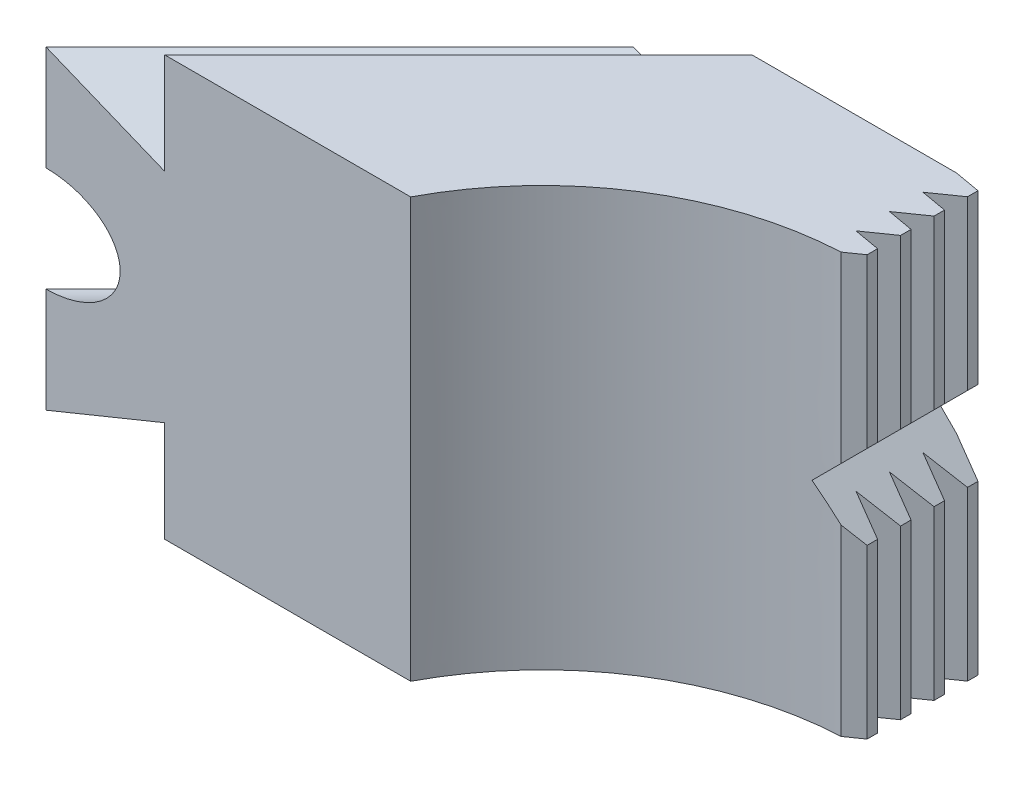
ISO-10303-21;
HEADER;
FILE_DESCRIPTION(('STEP AP214'),'2;1');
FILE_NAME('part.step','',(''),(''),'','','');
FILE_SCHEMA(('AUTOMOTIVE_DESIGN { 1 0 10303 214 1 1 1 1 }'));
ENDSEC;
DATA;
#1=APPLICATION_CONTEXT('core data for automotive mechanical design processes');
#2=APPLICATION_PROTOCOL_DEFINITION('international standard','automotive_design',2000,#1);
#3=PRODUCT_CONTEXT('',#1,'mechanical');
#4=PRODUCT('Part','Part','',(#3));
#5=PRODUCT_RELATED_PRODUCT_CATEGORY('part','',(#4));
#6=PRODUCT_DEFINITION_FORMATION('','',#4);
#7=PRODUCT_DEFINITION_CONTEXT('part definition',#1,'design');
#8=PRODUCT_DEFINITION('design','',#6,#7);
#9=PRODUCT_DEFINITION_SHAPE('','',#8);
#10=(LENGTH_UNIT() NAMED_UNIT(*) SI_UNIT(.MILLI.,.METRE.));
#11=(NAMED_UNIT(*) PLANE_ANGLE_UNIT() SI_UNIT($,.RADIAN.));
#12=(NAMED_UNIT(*) SI_UNIT($,.STERADIAN.) SOLID_ANGLE_UNIT());
#13=UNCERTAINTY_MEASURE_WITH_UNIT(LENGTH_MEASURE(1.E-05),#10,'distance_accuracy_value','');
#14=(GEOMETRIC_REPRESENTATION_CONTEXT(3) GLOBAL_UNCERTAINTY_ASSIGNED_CONTEXT((#13)) GLOBAL_UNIT_ASSIGNED_CONTEXT((#10,
#11,#12)) REPRESENTATION_CONTEXT('',''));
#15=CARTESIAN_POINT('',(0.,0.,0.));
#16=DIRECTION('',(0.,0.,1.));
#17=DIRECTION('',(1.,0.,0.));
#18=AXIS2_PLACEMENT_3D('',#15,#16,#17);
#19=CARTESIAN_POINT('',(-28.6036748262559,-7.14331507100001,13.322745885));
#20=DIRECTION('',(-0.707106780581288,-1.52498014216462E-11,0.707106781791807));
#21=DIRECTION('',(0.692798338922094,-0.200152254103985,0.692798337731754));
#22=AXIS2_PLACEMENT_3D('',#19,#20,#21);
#23=PLANE('',#22);
#24=CARTESIAN_POINT('',(-20.3095157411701,4.52533979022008,21.6169049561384));
#25=DIRECTION('',(0.529216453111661,-0.663219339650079,0.529216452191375));
#26=VECTOR('',#25,1.);
#27=LINE('',#24,#26);
#28=CARTESIAN_POINT('',(-20.3095157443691,4.5253397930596,21.6169049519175));
#29=VERTEX_POINT('',#28);
#30=CARTESIAN_POINT('',(-17.8651696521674,1.46206088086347,24.0612510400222));
#31=VERTEX_POINT('',#30);
#32=EDGE_CURVE('E438',#29,#31,#27,.T.);
#33=ORIENTED_EDGE('',*,*,#32,.T.);
#34=CARTESIAN_POINT('',(-17.865169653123,1.46206087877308,24.0612510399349));
#35=DIRECTION('',(-0.141529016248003,-0.97976480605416,-0.141529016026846));
#36=VECTOR('',#35,1.);
#37=LINE('',#34,#36);
#38=CARTESIAN_POINT('',(-18.51886417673,-3.06327891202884,23.4075565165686));
#39=VERTEX_POINT('',#38);
#40=EDGE_CURVE('E450',#31,#39,#37,.T.);
#41=ORIENTED_EDGE('',*,*,#40,.T.);
#42=CARTESIAN_POINT('',(-18.5188641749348,-3.06327891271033,23.4075565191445));
#43=DIRECTION('',(-0.670745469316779,-0.316545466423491,-0.670745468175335));
#44=VECTOR('',#43,1.);
#45=LINE('',#42,#44);
#46=CARTESIAN_POINT('',(-21.6169047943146,-4.52533979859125,20.3095159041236));
#47=VERTEX_POINT('',#46);
#48=EDGE_CURVE('E461',#39,#47,#45,.T.);
#49=ORIENTED_EDGE('',*,*,#48,.T.);
#50=CARTESIAN_POINT('',(-21.6169047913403,-4.52533980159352,20.3095159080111));
#51=DIRECTION('',(-0.529216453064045,0.66321933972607,-0.529216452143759));
#52=VECTOR('',#51,1.);
#53=LINE('',#50,#52);
#54=CARTESIAN_POINT('',(-24.0612508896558,-1.46206087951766,17.8651698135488));
#55=VERTEX_POINT('',#54);
#56=EDGE_CURVE('E473',#47,#55,#53,.T.);
#57=ORIENTED_EDGE('',*,*,#56,.T.);
#58=CARTESIAN_POINT('',(-24.0612508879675,-1.46206087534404,17.8651698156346));
#59=DIRECTION('',(0.141529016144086,0.979764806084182,0.141529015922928));
#60=VECTOR('',#59,1.);
#61=LINE('',#58,#60);
#62=CARTESIAN_POINT('',(-23.4075563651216,3.06327891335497,18.5188643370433));
#63=VERTEX_POINT('',#62);
#64=EDGE_CURVE('E485',#55,#63,#61,.T.);
#65=ORIENTED_EDGE('',*,*,#64,.T.);
#66=CARTESIAN_POINT('',(-23.4075563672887,3.06327891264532,18.5188643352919));
#67=DIRECTION('',(0.670745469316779,0.31654546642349,0.670745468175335));
#68=VECTOR('',#67,1.);
#69=LINE('',#66,#68);
#70=EDGE_CURVE('E497',#63,#29,#69,.T.);
#71=ORIENTED_EDGE('',*,*,#70,.T.);
#72=EDGE_LOOP('',(#33,#41,#49,#57,#65,#71));
#73=FACE_BOUND('',#72,.T.);
#74=DIRECTION('',(0.,-1.,0.));
#75=VECTOR('',#74,1.);
#76=CARTESIAN_POINT('',(-20.9632103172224,8.90000000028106,20.9632103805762));
#77=LINE('',#76,#75);
#78=CARTESIAN_POINT('',(-20.9632103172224,8.90000000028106,20.9632103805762));
#79=VERTEX_POINT('',#78);
#80=CARTESIAN_POINT('',(-20.9632103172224,4.99999999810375,20.9632103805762));
#81=VERTEX_POINT('',#80);
#82=EDGE_CURVE('E2393',#79,#81,#77,.T.);
#83=ORIENTED_EDGE('',*,*,#82,.F.);
#84=CARTESIAN_POINT('',(-20.9632059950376,8.89999999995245,20.9632147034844));
#85=CARTESIAN_POINT('',(-21.3764716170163,8.89996427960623,20.5499490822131));
#86=CARTESIAN_POINT('',(-21.7858972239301,8.84289932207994,20.140523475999));
#87=CARTESIAN_POINT('',(-22.5960363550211,8.61507626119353,19.33038434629));
#88=CARTESIAN_POINT('',(-22.9899647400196,8.44600667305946,18.9364559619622));
#89=CARTESIAN_POINT('',(-23.753109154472,7.99904428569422,18.1733115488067));
#90=CARTESIAN_POINT('',(-24.1161452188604,7.72453872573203,17.8102754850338));
#91=CARTESIAN_POINT('',(-24.8029677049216,7.07561352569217,17.1234530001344));
#92=CARTESIAN_POINT('',(-25.1211601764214,6.70622108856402,16.8052605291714));
#93=CARTESIAN_POINT('',(-25.7052665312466,5.88027090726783,16.2211541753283));
#94=CARTESIAN_POINT('',(-25.9663874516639,5.43018713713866,15.9600332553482));
#95=CARTESIAN_POINT('',(-26.4253307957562,4.45895277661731,15.5010899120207));
#96=CARTESIAN_POINT('',(-26.6193454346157,3.94547414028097,15.3070752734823));
#97=CARTESIAN_POINT('',(-26.9354888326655,2.86627959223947,14.9909318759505));
#98=CARTESIAN_POINT('',(-27.0549413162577,2.30913878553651,14.8714793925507));
#99=CARTESIAN_POINT('',(-27.2161355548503,1.16345689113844,14.7102851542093));
#100=CARTESIAN_POINT('',(-27.2564353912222,0.584064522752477,14.669985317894));
#101=CARTESIAN_POINT('',(-27.256485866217,-0.584076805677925,14.669934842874));
#102=CARTESIAN_POINT('',(-27.2160843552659,-1.16345501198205,14.7103363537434));
#103=CARTESIAN_POINT('',(-27.0549891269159,-2.30916475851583,14.871431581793));
#104=CARTESIAN_POINT('',(-26.9354388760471,-2.86626362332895,14.9909818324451));
#105=CARTESIAN_POINT('',(-26.6193887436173,-3.94551280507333,15.3070319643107));
#106=CARTESIAN_POINT('',(-26.4252840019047,-4.45892333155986,15.5011367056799));
#107=CARTESIAN_POINT('',(-25.9664245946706,-5.43023700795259,15.9599961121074));
#108=CARTESIAN_POINT('',(-25.705224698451,-5.88022911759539,16.2211960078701));
#109=CARTESIAN_POINT('',(-25.1211897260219,-6.70628024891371,16.8052309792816));
#110=CARTESIAN_POINT('',(-24.8029324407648,-7.07556099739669,17.123488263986));
#111=CARTESIAN_POINT('',(-24.1161660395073,-7.72460490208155,17.8102546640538));
#112=CARTESIAN_POINT('',(-23.7530818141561,-7.99898303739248,18.1733388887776));
#113=CARTESIAN_POINT('',(-22.9899760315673,-8.44607732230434,18.9364446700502));
#114=CARTESIAN_POINT('',(-22.5960179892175,-8.61500864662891,19.3304027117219));
#115=CARTESIAN_POINT('',(-21.785898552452,-8.84297172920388,20.1405221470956));
#116=CARTESIAN_POINT('',(-21.3767362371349,-8.89996426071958,20.549684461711));
#117=CARTESIAN_POINT('',(-20.9632059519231,-8.89999999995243,20.9632147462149));
#118=B_SPLINE_CURVE_WITH_KNOTS('',3,(#84,#85,#86,#87,#88,#89,#90,#91,#92,#93,#94,#95,#96,#97,
#98,#99,#100,#101,#102,#103,#104,#105,#106,#107,#108,#109,#110,#111,#112,#113,#114,#115,#116,
#117),.UNSPECIFIED.,.F.,.F.,(4,2,2,2,2,2,2,2,2,2,2,2,2,2,2,2,4),(0.,0.0625,0.125,0.1875,0.25,
0.3125,0.375,0.4375,0.5,0.5625,0.625,0.6875,0.75,0.8125,0.875,0.9375,1.),.UNSPECIFIED.);
#119=CARTESIAN_POINT('',(-20.9632103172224,-8.89999999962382,20.9632103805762));
#120=VERTEX_POINT('',#119);
#121=EDGE_CURVE('E9',#120,#79,#118,.F.);
#122=ORIENTED_EDGE('',*,*,#121,.F.);
#123=DIRECTION('',(0.,-1.,0.));
#124=VECTOR('',#123,1.);
#125=CARTESIAN_POINT('',(-20.9632103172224,-5.00000000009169,20.9632103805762));
#126=LINE('',#125,#124);
#127=CARTESIAN_POINT('',(-20.9632103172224,-5.00000000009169,20.9632103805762));
#128=VERTEX_POINT('',#127);
#129=EDGE_CURVE('E2442',#128,#120,#126,.T.);
#130=ORIENTED_EDGE('',*,*,#129,.F.);
#131=CARTESIAN_POINT('',(-20.9632103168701,0.,20.9632103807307));
#132=DIRECTION('',(0.707106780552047,0.,-0.707106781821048));
#133=DIRECTION('',(0.707106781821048,-1.79586368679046E-10,0.707106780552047));
#134=AXIS2_PLACEMENT_3D('',#131,#132,#133);
#135=CIRCLE('',#134,4.99999999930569);
#136=CARTESIAN_POINT('',(-17.4276764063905,1.7309278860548E-09,24.4987442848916));
#137=VERTEX_POINT('',#136);
#138=EDGE_CURVE('E35',#128,#137,#135,.F.);
#139=ORIENTED_EDGE('',*,*,#138,.T.);
#140=CARTESIAN_POINT('',(-20.9632103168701,0.,20.9632103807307));
#141=DIRECTION('',(0.707106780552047,0.,-0.707106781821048));
#142=DIRECTION('',(-1.45029821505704E-10,1.,-1.45029821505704E-10));
#143=AXIS2_PLACEMENT_3D('',#140,#141,#142);
#144=CIRCLE('',#143,4.99999999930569);
#145=EDGE_CURVE('E26',#137,#81,#144,.F.);
#146=ORIENTED_EDGE('',*,*,#145,.T.);
#147=EDGE_LOOP('',(#83,#122,#130,#139,#146));
#148=FACE_BOUND('',#147,.T.);
#149=ADVANCED_FACE('F14',(#73,#148),#23,.T.);
#150=CARTESIAN_POINT('',(-184.366321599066,8.89999999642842,184.366330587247));
#151=CARTESIAN_POINT('',(-184.779587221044,8.8999642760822,183.953064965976));
#152=CARTESIAN_POINT('',(-185.189012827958,8.84289931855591,183.543639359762));
#153=CARTESIAN_POINT('',(-185.999151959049,8.6150762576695,182.733500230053));
#154=CARTESIAN_POINT('',(-186.393080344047,8.44600666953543,182.339571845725));
#155=CARTESIAN_POINT('',(-187.1562247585,7.99904428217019,181.576427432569));
#156=CARTESIAN_POINT('',(-187.519260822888,7.724538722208,181.213391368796));
#157=CARTESIAN_POINT('',(-188.20608330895,7.07561352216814,180.526568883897));
#158=CARTESIAN_POINT('',(-188.524275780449,6.70622108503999,180.208376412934));
#159=CARTESIAN_POINT('',(-189.108382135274,5.8802709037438,179.624270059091));
#160=CARTESIAN_POINT('',(-189.369503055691,5.43018713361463,179.363149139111));
#161=CARTESIAN_POINT('',(-189.828446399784,4.45895277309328,178.904205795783));
#162=CARTESIAN_POINT('',(-190.022461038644,3.94547413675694,178.710191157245));
#163=CARTESIAN_POINT('',(-190.338604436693,2.86627958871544,178.394047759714));
#164=CARTESIAN_POINT('',(-190.458056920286,2.30913878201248,178.274595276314));
#165=CARTESIAN_POINT('',(-190.619251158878,1.16345688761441,178.113401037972));
#166=CARTESIAN_POINT('',(-190.65955099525,0.584064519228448,178.073101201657));
#167=CARTESIAN_POINT('',(-190.659601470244,-0.584076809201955,178.073050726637));
#168=CARTESIAN_POINT('',(-190.619199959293,-1.16345501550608,178.113452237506));
#169=CARTESIAN_POINT('',(-190.458104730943,-2.30916476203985,178.274547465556));
#170=CARTESIAN_POINT('',(-190.338554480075,-2.86626362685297,178.394097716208));
#171=CARTESIAN_POINT('',(-190.022504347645,-3.94551280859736,178.710147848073));
#172=CARTESIAN_POINT('',(-189.828399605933,-4.45892333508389,178.904252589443));
#173=CARTESIAN_POINT('',(-189.369540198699,-5.43023701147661,179.36311199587));
#174=CARTESIAN_POINT('',(-189.108340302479,-5.88022912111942,179.624311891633));
#175=CARTESIAN_POINT('',(-188.524305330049,-6.70628025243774,180.208346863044));
#176=CARTESIAN_POINT('',(-188.206048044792,-7.07556100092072,180.526604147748));
#177=CARTESIAN_POINT('',(-187.519281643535,-7.72460490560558,181.213370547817));
#178=CARTESIAN_POINT('',(-187.156197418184,-7.99898304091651,181.576454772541));
#179=CARTESIAN_POINT('',(-186.393091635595,-8.44607732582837,182.339560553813));
#180=CARTESIAN_POINT('',(-185.999133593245,-8.61500865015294,182.733518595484));
#181=CARTESIAN_POINT('',(-185.18901415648,-8.84297173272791,183.543638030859));
#182=CARTESIAN_POINT('',(-184.779851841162,-8.89996426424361,183.952800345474));
#183=CARTESIAN_POINT('',(-184.366321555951,-8.90000000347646,184.366330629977));
#184=B_SPLINE_CURVE_WITH_KNOTS('',3,(#150,#151,#152,#153,#154,#155,#156,#157,#158,#159,#160,
#161,#162,#163,#164,#165,#166,#167,#168,#169,#170,#171,#172,#173,#174,#175,#176,#177,#178,#179,
#180,#181,#182,#183),.UNSPECIFIED.,.F.,.F.,(4,2,2,2,2,2,2,2,2,2,2,2,2,2,2,2,4),(0.,0.0625,0.125,
0.1875,0.25,0.3125,0.375,0.4375,0.5,0.5625,0.625,0.6875,0.75,0.8125,0.875,0.9375,1.),.UNSPECIFIED.);
#185=DIRECTION('',(0.707106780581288,1.52498014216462E-11,-0.707106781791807));
#186=VECTOR('',#185,1.);
#187=SURFACE_OF_LINEAR_EXTRUSION('',#184,#186);
#188=CARTESIAN_POINT('',(-6.82107038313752,8.90000000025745,6.82107906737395));
#189=CARTESIAN_POINT('',(-7.23433600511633,8.89996427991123,6.40781344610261));
#190=CARTESIAN_POINT('',(-7.64376161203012,8.84289932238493,5.99838783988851));
#191=CARTESIAN_POINT('',(-8.45390074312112,8.61507626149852,5.18824871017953));
#192=CARTESIAN_POINT('',(-8.84782912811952,8.44600667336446,4.79432032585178));
#193=CARTESIAN_POINT('',(-9.61097354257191,7.99904428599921,4.03117591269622));
#194=CARTESIAN_POINT('',(-9.97400960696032,7.72453872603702,3.66813984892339));
#195=CARTESIAN_POINT('',(-10.6608320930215,7.07561352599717,2.98131736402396));
#196=CARTESIAN_POINT('',(-10.9790245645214,6.70622108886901,2.66312489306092));
#197=CARTESIAN_POINT('',(-11.5631309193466,5.88027090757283,2.07901853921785));
#198=CARTESIAN_POINT('',(-11.8242518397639,5.43018713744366,1.81789761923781));
#199=CARTESIAN_POINT('',(-12.2831951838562,4.4589527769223,1.35895427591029));
#200=CARTESIAN_POINT('',(-12.4772098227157,3.94547414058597,1.16493963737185));
#201=CARTESIAN_POINT('',(-12.7933532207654,2.86627959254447,0.84879623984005));
#202=CARTESIAN_POINT('',(-12.9128057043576,2.3091387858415,0.72934375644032));
#203=CARTESIAN_POINT('',(-13.0739999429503,1.16345689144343,0.568149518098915));
#204=CARTESIAN_POINT('',(-13.1142997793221,0.584064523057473,0.527849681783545));
#205=CARTESIAN_POINT('',(-13.114350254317,-0.584076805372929,0.5277992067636));
#206=CARTESIAN_POINT('',(-13.0739487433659,-1.16345501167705,0.568200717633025));
#207=CARTESIAN_POINT('',(-12.9128535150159,-2.30916475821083,0.72929594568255));
#208=CARTESIAN_POINT('',(-12.7933032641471,-2.86626362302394,0.848846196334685));
#209=CARTESIAN_POINT('',(-12.4772531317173,-3.94551280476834,1.16489632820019));
#210=CARTESIAN_POINT('',(-12.2831483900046,-4.45892333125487,1.35900106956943));
#211=CARTESIAN_POINT('',(-11.8242889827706,-5.43023700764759,1.81786047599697));
#212=CARTESIAN_POINT('',(-11.563089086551,-5.88022911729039,2.0790603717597));
#213=CARTESIAN_POINT('',(-10.9790541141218,-6.70628024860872,2.66309534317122));
#214=CARTESIAN_POINT('',(-10.6607968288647,-7.07556099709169,2.98135262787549));
#215=CARTESIAN_POINT('',(-9.97403042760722,-7.72460490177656,3.66811902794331));
#216=CARTESIAN_POINT('',(-9.61094620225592,-7.99898303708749,4.03120325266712));
#217=CARTESIAN_POINT('',(-8.84784041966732,-8.44607732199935,4.79430903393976));
#218=CARTESIAN_POINT('',(-8.45388237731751,-8.61500864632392,5.18826707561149));
#219=CARTESIAN_POINT('',(-7.64376294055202,-8.84297172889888,5.99838651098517));
#220=CARTESIAN_POINT('',(-7.23460062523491,-8.89996426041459,6.40754882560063));
#221=CARTESIAN_POINT('',(-6.82107034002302,-8.89999999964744,6.82107911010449));
#222=B_SPLINE_CURVE_WITH_KNOTS('',3,(#188,#189,#190,#191,#192,#193,#194,#195,#196,#197,#198,
#199,#200,#201,#202,#203,#204,#205,#206,#207,#208,#209,#210,#211,#212,#213,#214,#215,#216,#217,
#218,#219,#220,#221),.UNSPECIFIED.,.F.,.F.,(4,2,2,2,2,2,2,2,2,2,2,2,2,2,2,2,4),(0.,0.0625,0.125,
0.1875,0.25,0.3125,0.375,0.4375,0.5,0.5625,0.625,0.6875,0.75,0.8125,0.875,0.9375,1.),.UNSPECIFIED.);
#223=CARTESIAN_POINT('',(-6.82107470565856,-8.89999999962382,6.82107474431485));
#224=VERTEX_POINT('',#223);
#225=CARTESIAN_POINT('',(-6.82107470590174,8.90000000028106,6.82107474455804));
#226=VERTEX_POINT('',#225);
#227=EDGE_CURVE('E2348',#224,#226,#222,.F.);
#228=ORIENTED_EDGE('',*,*,#227,.F.);
#229=DIRECTION('',(0.707106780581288,1.52498014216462E-11,-0.707106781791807));
#230=VECTOR('',#229,1.);
#231=CARTESIAN_POINT('',(-184.366321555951,-8.90000000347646,184.366330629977));
#232=LINE('',#231,#230);
#233=EDGE_CURVE('E2370',#120,#224,#232,.T.);
#234=ORIENTED_EDGE('',*,*,#233,.F.);
#235=ORIENTED_EDGE('',*,*,#121,.T.);
#236=DIRECTION('',(0.707106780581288,1.52498014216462E-11,-0.707106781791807));
#237=VECTOR('',#236,1.);
#238=CARTESIAN_POINT('',(-184.366321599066,8.89999999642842,184.366330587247));
#239=LINE('',#238,#237);
#240=EDGE_CURVE('E2367',#79,#226,#239,.T.);
#241=ORIENTED_EDGE('',*,*,#240,.T.);
#242=EDGE_LOOP('',(#228,#234,#235,#241));
#243=FACE_BOUND('',#242,.T.);
#244=ADVANCED_FACE('F2417',(#243),#187,.F.);
#245=CARTESIAN_POINT('',(-178.70947163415,19.9999999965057,190.023180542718));
#246=DIRECTION('',(0.707106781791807,-1.54113073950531E-10,0.707106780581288));
#247=DIRECTION('',(-0.707106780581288,0.,0.707106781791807));
#248=AXIS2_PLACEMENT_3D('',#245,#246,#247);
#249=PLANE('',#248);
#250=DIRECTION('',(0.707106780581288,1.52498014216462E-11,-0.707106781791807));
#251=VECTOR('',#250,1.);
#252=CARTESIAN_POINT('',(-178.70947163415,19.9999999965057,190.023180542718));
#253=LINE('',#252,#251);
#254=CARTESIAN_POINT('',(-16.6862914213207,20.,28.0000000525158));
#255=VERTEX_POINT('',#254);
#256=CARTESIAN_POINT('',(11.3137085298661,20.,4.25932843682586E-08));
#257=VERTEX_POINT('',#256);
#258=EDGE_CURVE('E2340',#255,#257,#253,.T.);
#259=ORIENTED_EDGE('',*,*,#258,.T.);
#260=CARTESIAN_POINT('',(11.3137085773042,10.3811978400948,-1.02818514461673E-08));
#261=DIRECTION('',(0.,1.,0.));
#262=VECTOR('',#261,1.);
#263=LINE('',#260,#262);
#264=CARTESIAN_POINT('',(11.3137085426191,10.3811978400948,4.18899294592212E-08));
#265=VERTEX_POINT('',#264);
#266=EDGE_CURVE('E1405',#265,#257,#263,.T.);
#267=ORIENTED_EDGE('',*,*,#266,.F.);
#268=DIRECTION('',(0.707106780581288,1.52498014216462E-11,-0.707106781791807));
#269=VECTOR('',#268,1.);
#270=CARTESIAN_POINT('',(-178.709471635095,10.3811978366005,190.023180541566));
#271=LINE('',#270,#269);
#272=CARTESIAN_POINT('',(-16.686291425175,10.3811978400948,28.0000000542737));
#273=VERTEX_POINT('',#272);
#274=EDGE_CURVE('E2349',#273,#265,#271,.T.);
#275=ORIENTED_EDGE('',*,*,#274,.F.);
#276=CARTESIAN_POINT('',(-16.6862914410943,20.,28.000000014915));
#277=DIRECTION('',(0.,-1.,0.));
#278=VECTOR('',#277,1.);
#279=LINE('',#276,#278);
#280=EDGE_CURVE('E2346',#255,#273,#279,.T.);
#281=ORIENTED_EDGE('',*,*,#280,.F.);
#282=EDGE_LOOP('',(#259,#267,#275,#281));
#283=FACE_BOUND('',#282,.T.);
#284=ADVANCED_FACE('F538',(#283),#249,.F.);
#285=CARTESIAN_POINT('',(-178.709471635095,10.3811978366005,190.023180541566));
#286=DIRECTION('',(-0.353553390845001,-0.866025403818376,-0.353553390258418));
#287=DIRECTION('',(0.925820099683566,-0.377964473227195,0.));
#288=AXIS2_PLACEMENT_3D('',#285,#286,#287);
#289=PLANE('',#288);
#290=ORIENTED_EDGE('',*,*,#274,.T.);
#291=DIRECTION('',(0.925820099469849,-0.377964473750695,-8.41381464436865E-10));
#292=VECTOR('',#291,1.);
#293=CARTESIAN_POINT('',(2.67441763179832E-08,15.000000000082,0.));
#294=LINE('',#293,#292);
#295=CARTESIAN_POINT('',(0.,15.000000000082,2.67441095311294E-08));
#296=VERTEX_POINT('',#295);
#297=EDGE_CURVE('E2506',#296,#265,#294,.T.);
#298=ORIENTED_EDGE('',*,*,#297,.F.);
#299=DIRECTION('',(0.707106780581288,1.52498014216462E-11,-0.707106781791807));
#300=VECTOR('',#299,1.);
#301=CARTESIAN_POINT('',(-184.366325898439,14.9999999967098,184.366326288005));
#302=LINE('',#301,#300);
#303=CARTESIAN_POINT('',(-27.9999999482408,15.000000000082,28.0000000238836));
#304=VERTEX_POINT('',#303);
#305=EDGE_CURVE('E2352',#304,#296,#302,.T.);
#306=ORIENTED_EDGE('',*,*,#305,.F.);
#307=DIRECTION('',(-0.925820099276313,0.377964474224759,8.25270132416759E-10));
#308=VECTOR('',#307,1.);
#309=CARTESIAN_POINT('',(-16.6862914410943,10.3811978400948,28.000000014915));
#310=LINE('',#309,#308);
#311=EDGE_CURVE('E2511',#273,#304,#310,.T.);
#312=ORIENTED_EDGE('',*,*,#311,.F.);
#313=EDGE_LOOP('',(#290,#298,#306,#312));
#314=FACE_BOUND('',#313,.T.);
#315=ADVANCED_FACE('F2428',(#314),#289,.F.);
#316=CARTESIAN_POINT('',(-184.366325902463,-15.0000000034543,184.366326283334));
#317=DIRECTION('',(-0.353553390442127,0.866025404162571,-0.35355338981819));
#318=DIRECTION('',(-0.925820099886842,-0.377964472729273,0.));
#319=AXIS2_PLACEMENT_3D('',#316,#317,#318);
#320=PLANE('',#319);
#321=DIRECTION('',(0.707106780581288,1.52498014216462E-11,-0.707106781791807));
#322=VECTOR('',#321,1.);
#323=CARTESIAN_POINT('',(-184.366325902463,-15.0000000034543,184.366326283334));
#324=LINE('',#323,#322);
#325=CARTESIAN_POINT('',(-27.9999999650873,-15.000000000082,28.00000004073));
#326=VERTEX_POINT('',#325);
#327=CARTESIAN_POINT('',(0.,-15.000000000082,2.67441095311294E-08));
#328=VERTEX_POINT('',#327);
#329=EDGE_CURVE('E2386',#326,#328,#324,.T.);
#330=ORIENTED_EDGE('',*,*,#329,.T.);
#331=DIRECTION('',(-0.925820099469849,-0.377964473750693,8.41381464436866E-10));
#332=VECTOR('',#331,1.);
#333=CARTESIAN_POINT('',(11.3137085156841,-10.3811978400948,-1.02818504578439E-08));
#334=LINE('',#333,#332);
#335=CARTESIAN_POINT('',(11.3137085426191,-10.3811978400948,4.18899294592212E-08));
#336=VERTEX_POINT('',#335);
#337=EDGE_CURVE('E2498',#336,#328,#334,.T.);
#338=ORIENTED_EDGE('',*,*,#337,.F.);
#339=DIRECTION('',(0.707106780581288,1.52498014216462E-11,-0.707106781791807));
#340=VECTOR('',#339,1.);
#341=CARTESIAN_POINT('',(-178.709471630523,-10.3811978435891,190.023180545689));
#342=LINE('',#341,#340);
#343=CARTESIAN_POINT('',(-16.6862914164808,-10.3811978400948,28.0000000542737));
#344=VERTEX_POINT('',#343);
#345=EDGE_CURVE('E2391',#344,#336,#342,.T.);
#346=ORIENTED_EDGE('',*,*,#345,.F.);
#347=DIRECTION('',(0.925820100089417,0.37796447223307,-8.25270128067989E-10));
#348=VECTOR('',#347,1.);
#349=CARTESIAN_POINT('',(-27.9999999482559,-15.000000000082,28.000000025));
#350=LINE('',#349,#348);
#351=EDGE_CURVE('E2515',#326,#344,#350,.T.);
#352=ORIENTED_EDGE('',*,*,#351,.F.);
#353=EDGE_LOOP('',(#330,#338,#346,#352));
#354=FACE_BOUND('',#353,.T.);
#355=ADVANCED_FACE('F2416',(#354),#320,.F.);
#356=CARTESIAN_POINT('',(-178.709471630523,-10.3811978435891,190.023180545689));
#357=DIRECTION('',(0.707106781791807,-4.85027904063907E-10,0.707106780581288));
#358=DIRECTION('',(-0.707106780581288,0.,0.707106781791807));
#359=AXIS2_PLACEMENT_3D('',#356,#357,#358);
#360=PLANE('',#359);
#361=ORIENTED_EDGE('',*,*,#345,.T.);
#362=CARTESIAN_POINT('',(11.3137085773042,-20.,-1.02818514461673E-08));
#363=DIRECTION('',(0.,1.,0.));
#364=VECTOR('',#363,1.);
#365=LINE('',#362,#364);
#366=CARTESIAN_POINT('',(11.3137085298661,-20.,4.25932895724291E-08));
#367=VERTEX_POINT('',#366);
#368=EDGE_CURVE('E1479',#367,#336,#365,.T.);
#369=ORIENTED_EDGE('',*,*,#368,.F.);
#370=DIRECTION('',(0.707106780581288,1.52498014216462E-11,-0.707106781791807));
#371=VECTOR('',#370,1.);
#372=CARTESIAN_POINT('',(-178.709471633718,-20.0000000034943,190.023180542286));
#373=LINE('',#372,#371);
#374=CARTESIAN_POINT('',(-16.6862914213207,-20.,28.0000000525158));
#375=VERTEX_POINT('',#374);
#376=EDGE_CURVE('E2378',#375,#367,#373,.T.);
#377=ORIENTED_EDGE('',*,*,#376,.F.);
#378=CARTESIAN_POINT('',(-16.6862914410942,-10.3811978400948,28.000000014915));
#379=DIRECTION('',(0.,-1.,0.));
#380=VECTOR('',#379,1.);
#381=LINE('',#378,#380);
#382=EDGE_CURVE('E2401',#344,#375,#381,.T.);
#383=ORIENTED_EDGE('',*,*,#382,.F.);
#384=EDGE_LOOP('',(#361,#369,#377,#383));
#385=FACE_BOUND('',#384,.T.);
#386=ADVANCED_FACE('F2406',(#385),#360,.F.);
#387=CARTESIAN_POINT('',(33.3100000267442,-20.,0.440817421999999));
#388=DIRECTION('',(0.173648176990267,0.,-0.984807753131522));
#389=DIRECTION('',(-0.984807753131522,0.,-0.173648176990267));
#390=AXIS2_PLACEMENT_3D('',#387,#388,#389);
#391=PLANE('',#390);
#392=CARTESIAN_POINT('',(30.8100000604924,-20.,-2.20492478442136E-08));
#393=DIRECTION('',(0.984807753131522,0.,0.173648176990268));
#394=VECTOR('',#393,1.);
#395=LINE('',#392,#394);
#396=CARTESIAN_POINT('',(30.810000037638,-20.,-2.40000003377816E-08));
#397=VERTEX_POINT('',#396);
#398=CARTESIAN_POINT('',(33.3100000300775,-20.,0.440817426));
#399=VERTEX_POINT('',#398);
#400=EDGE_CURVE('E583',#397,#399,#395,.T.);
#401=ORIENTED_EDGE('',*,*,#400,.F.);
#402=CARTESIAN_POINT('',(30.8100000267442,-1.50000000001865,-2.80000003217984E-08));
#403=DIRECTION('',(0.,-1.,0.));
#404=VECTOR('',#403,1.);
#405=LINE('',#402,#404);
#406=CARTESIAN_POINT('',(30.8100000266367,-1.50000000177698,-2.80416653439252E-08));
#407=VERTEX_POINT('',#406);
#408=EDGE_CURVE('E594',#407,#397,#405,.T.);
#409=ORIENTED_EDGE('',*,*,#408,.F.);
#410=CARTESIAN_POINT('',(30.8100000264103,-1.49999999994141,-2.80588818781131E-08));
#411=DIRECTION('',(0.701673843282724,-0.701673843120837,0.123724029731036));
#412=VECTOR('',#411,1.);
#413=LINE('',#410,#412);
#414=CARTESIAN_POINT('',(33.3100000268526,-4.00000000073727,0.440817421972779));
#415=VERTEX_POINT('',#414);
#416=EDGE_CURVE('E604',#407,#415,#413,.T.);
#417=ORIENTED_EDGE('',*,*,#416,.T.);
#418=CARTESIAN_POINT('',(33.3100000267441,-20.,0.440817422));
#419=DIRECTION('',(0.,1.,0.));
#420=VECTOR('',#419,1.);
#421=LINE('',#418,#420);
#422=EDGE_CURVE('E274',#399,#415,#421,.T.);
#423=ORIENTED_EDGE('',*,*,#422,.F.);
#424=EDGE_LOOP('',(#401,#409,#417,#423));
#425=FACE_BOUND('',#424,.T.);
#426=ADVANCED_FACE('F543',(#425),#391,.T.);
#427=CARTESIAN_POINT('',(33.3100000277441,-20.,1.440817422));
#428=DIRECTION('',(1.,0.,-9.99977878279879E-10));
#429=DIRECTION('',(-9.99977878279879E-10,0.,-1.));
#430=AXIS2_PLACEMENT_3D('',#427,#428,#429);
#431=PLANE('',#430);
#432=CARTESIAN_POINT('',(33.310000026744,-20.,0.440817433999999));
#433=DIRECTION('',(1.00000564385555E-09,0.,1.));
#434=VECTOR('',#433,1.);
#435=LINE('',#432,#434);
#436=CARTESIAN_POINT('',(33.3100000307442,-20.,1.44081742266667));
#437=VERTEX_POINT('',#436);
#438=EDGE_CURVE('E624',#399,#437,#435,.T.);
#439=ORIENTED_EDGE('',*,*,#438,.F.);
#440=ORIENTED_EDGE('',*,*,#422,.T.);
#441=CARTESIAN_POINT('',(33.3100000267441,-4.,0.440817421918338));
#442=DIRECTION('',(9.99977876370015E-10,0.,1.));
#443=VECTOR('',#442,1.);
#444=LINE('',#441,#443);
#445=CARTESIAN_POINT('',(33.3100000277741,-4.00000000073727,1.44081742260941));
#446=VERTEX_POINT('',#445);
#447=EDGE_CURVE('E2594',#415,#446,#444,.T.);
#448=ORIENTED_EDGE('',*,*,#447,.T.);
#449=CARTESIAN_POINT('',(33.3100000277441,-20.,1.440817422));
#450=DIRECTION('',(0.,1.,0.));
#451=VECTOR('',#450,1.);
#452=LINE('',#449,#451);
#453=EDGE_CURVE('E656',#437,#446,#452,.T.);
#454=ORIENTED_EDGE('',*,*,#453,.F.);
#455=EDGE_LOOP('',(#439,#440,#448,#454));
#456=FACE_BOUND('',#455,.T.);
#457=ADVANCED_FACE('F628',(#456),#431,.T.);
#458=CARTESIAN_POINT('',(30.8100000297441,-20.,3.191336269));
#459=DIRECTION('',(0.573576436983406,0.,0.819152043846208));
#460=DIRECTION('',(0.819152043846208,0.,-0.573576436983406));
#461=AXIS2_PLACEMENT_3D('',#458,#459,#460);
#462=PLANE('',#461);
#463=CARTESIAN_POINT('',(33.3100000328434,-20.,1.44081741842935));
#464=DIRECTION('',(-0.819152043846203,0.,0.573576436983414));
#465=VECTOR('',#464,1.);
#466=LINE('',#463,#465);
#467=CARTESIAN_POINT('',(30.8100000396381,-20.,3.19133626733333));
#468=VERTEX_POINT('',#467);
#469=EDGE_CURVE('E669',#437,#468,#466,.T.);
#470=ORIENTED_EDGE('',*,*,#469,.F.);
#471=ORIENTED_EDGE('',*,*,#453,.T.);
#472=CARTESIAN_POINT('',(33.3100000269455,-4.00000000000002,1.44081742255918));
#473=DIRECTION('',(-0.633687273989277,0.63368727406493,0.443712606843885));
#474=VECTOR('',#473,1.);
#475=LINE('',#472,#474);
#476=CARTESIAN_POINT('',(30.8100000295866,-1.50000000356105,3.1913362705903));
#477=VERTEX_POINT('',#476);
#478=EDGE_CURVE('E690',#446,#477,#475,.T.);
#479=ORIENTED_EDGE('',*,*,#478,.T.);
#480=CARTESIAN_POINT('',(30.8100000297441,-20.,3.191336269));
#481=DIRECTION('',(0.,1.,0.));
#482=VECTOR('',#481,1.);
#483=LINE('',#480,#482);
#484=EDGE_CURVE('E700',#468,#477,#483,.T.);
#485=ORIENTED_EDGE('',*,*,#484,.F.);
#486=EDGE_LOOP('',(#470,#471,#479,#485));
#487=FACE_BOUND('',#486,.T.);
#488=ADVANCED_FACE('F637',(#487),#462,.T.);
#489=CARTESIAN_POINT('',(33.3100000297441,-20.,3.632153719));
#490=DIRECTION('',(0.173648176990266,0.,-0.984807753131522));
#491=DIRECTION('',(-0.984807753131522,0.,-0.173648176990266));
#492=AXIS2_PLACEMENT_3D('',#489,#490,#491);
#493=PLANE('',#492);
#494=CARTESIAN_POINT('',(30.8100000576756,-20.,3.1913362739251));
#495=DIRECTION('',(0.984807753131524,0.,0.173648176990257));
#496=VECTOR('',#495,1.);
#497=LINE('',#494,#496);
#498=CARTESIAN_POINT('',(33.3100000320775,-20.,3.63215371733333));
#499=VERTEX_POINT('',#498);
#500=EDGE_CURVE('E713',#468,#499,#497,.T.);
#501=ORIENTED_EDGE('',*,*,#500,.F.);
#502=ORIENTED_EDGE('',*,*,#484,.T.);
#503=CARTESIAN_POINT('',(30.8100000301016,-1.49999999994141,3.19133626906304));
#504=DIRECTION('',(0.701673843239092,-0.701673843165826,0.123724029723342));
#505=VECTOR('',#504,1.);
#506=LINE('',#503,#505);
#507=CARTESIAN_POINT('',(33.3100000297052,-4.00000000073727,3.63215372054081));
#508=VERTEX_POINT('',#507);
#509=EDGE_CURVE('E2592',#477,#508,#506,.T.);
#510=ORIENTED_EDGE('',*,*,#509,.T.);
#511=CARTESIAN_POINT('',(33.3100000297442,-20.,3.632153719));
#512=DIRECTION('',(0.,1.,0.));
#513=VECTOR('',#512,1.);
#514=LINE('',#511,#513);
#515=EDGE_CURVE('E747',#499,#508,#514,.T.);
#516=ORIENTED_EDGE('',*,*,#515,.F.);
#517=EDGE_LOOP('',(#501,#502,#510,#516));
#518=FACE_BOUND('',#517,.T.);
#519=ADVANCED_FACE('F718',(#518),#493,.T.);
#520=CARTESIAN_POINT('',(33.3100000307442,-20.,4.632153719));
#521=DIRECTION('',(1.,0.,-1.00000563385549E-09));
#522=DIRECTION('',(-1.00000563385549E-09,0.,-1.));
#523=AXIS2_PLACEMENT_3D('',#520,#521,#522);
#524=PLANE('',#523);
#525=CARTESIAN_POINT('',(33.310000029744,-20.,3.632153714));
#526=DIRECTION('',(9.99977888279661E-10,0.,1.));
#527=VECTOR('',#526,1.);
#528=LINE('',#525,#527);
#529=CARTESIAN_POINT('',(33.3100000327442,-20.,4.632153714));
#530=VERTEX_POINT('',#529);
#531=EDGE_CURVE('E760',#499,#530,#528,.T.);
#532=ORIENTED_EDGE('',*,*,#531,.F.);
#533=ORIENTED_EDGE('',*,*,#515,.T.);
#534=CARTESIAN_POINT('',(33.3100000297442,-4.,3.63215372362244));
#535=DIRECTION('',(1.00000564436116E-09,0.,1.));
#536=VECTOR('',#535,1.);
#537=LINE('',#534,#536);
#538=CARTESIAN_POINT('',(33.31000003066,-4.00000000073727,4.63215371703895));
#539=VERTEX_POINT('',#538);
#540=EDGE_CURVE('E781',#508,#539,#537,.T.);
#541=ORIENTED_EDGE('',*,*,#540,.T.);
#542=CARTESIAN_POINT('',(33.3100000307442,-20.,4.632153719));
#543=DIRECTION('',(0.,1.,0.));
#544=VECTOR('',#543,1.);
#545=LINE('',#542,#544);
#546=EDGE_CURVE('E791',#530,#539,#545,.T.);
#547=ORIENTED_EDGE('',*,*,#546,.F.);
#548=EDGE_LOOP('',(#532,#533,#541,#547));
#549=FACE_BOUND('',#548,.T.);
#550=ADVANCED_FACE('F727',(#549),#524,.T.);
#551=CARTESIAN_POINT('',(30.8100000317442,-20.,6.382672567));
#552=DIRECTION('',(0.573576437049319,0.,0.819152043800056));
#553=DIRECTION('',(0.819152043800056,0.,-0.573576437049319));
#554=AXIS2_PLACEMENT_3D('',#551,#552,#553);
#555=PLANE('',#554);
#556=CARTESIAN_POINT('',(33.3100000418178,-20.,4.63215371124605));
#557=DIRECTION('',(-0.819152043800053,0.,0.573576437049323));
#558=VECTOR('',#557,1.);
#559=LINE('',#556,#558);
#560=CARTESIAN_POINT('',(30.8100000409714,-20.,6.38267256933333));
#561=VERTEX_POINT('',#560);
#562=EDGE_CURVE('E804',#530,#561,#559,.T.);
#563=ORIENTED_EDGE('',*,*,#562,.F.);
#564=ORIENTED_EDGE('',*,*,#546,.T.);
#565=CARTESIAN_POINT('',(33.3100000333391,-3.99999999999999,4.63215371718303));
#566=DIRECTION('',(-0.633687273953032,0.633687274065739,0.443712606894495));
#567=VECTOR('',#566,1.);
#568=LINE('',#565,#567);
#569=CARTESIAN_POINT('',(30.8100000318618,-1.50000000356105,6.3826725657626));
#570=VERTEX_POINT('',#569);
#571=EDGE_CURVE('E2590',#539,#570,#568,.T.);
#572=ORIENTED_EDGE('',*,*,#571,.T.);
#573=CARTESIAN_POINT('',(30.8100000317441,-20.,6.382672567));
#574=DIRECTION('',(0.,1.,0.));
#575=VECTOR('',#574,1.);
#576=LINE('',#573,#575);
#577=EDGE_CURVE('E838',#561,#570,#576,.T.);
#578=ORIENTED_EDGE('',*,*,#577,.F.);
#579=EDGE_LOOP('',(#563,#564,#572,#578));
#580=FACE_BOUND('',#579,.T.);
#581=ADVANCED_FACE('F809',(#580),#555,.T.);
#582=CARTESIAN_POINT('',(33.3100000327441,-20.,6.823490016));
#583=DIRECTION('',(0.173648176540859,0.,-0.984807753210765));
#584=DIRECTION('',(-0.984807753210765,0.,-0.173648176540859));
#585=AXIS2_PLACEMENT_3D('',#582,#583,#584);
#586=PLANE('',#585);
#587=CARTESIAN_POINT('',(30.810000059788,-20.,6.3826725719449));
#588=DIRECTION('',(0.984807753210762,0.,0.173648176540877));
#589=VECTOR('',#588,1.);
#590=LINE('',#587,#589);
#591=CARTESIAN_POINT('',(33.3100000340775,-20.,6.82349001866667));
#592=VERTEX_POINT('',#591);
#593=EDGE_CURVE('E851',#561,#592,#590,.T.);
#594=ORIENTED_EDGE('',*,*,#593,.F.);
#595=ORIENTED_EDGE('',*,*,#577,.T.);
#596=CARTESIAN_POINT('',(30.8100000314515,-1.4999999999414,6.38267256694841));
#597=DIRECTION('',(0.701673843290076,-0.701673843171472,0.123724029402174));
#598=VECTOR('',#597,1.);
#599=LINE('',#596,#598);
#600=CARTESIAN_POINT('',(33.3100000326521,-4.00000000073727,6.82349001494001));
#601=VERTEX_POINT('',#600);
#602=EDGE_CURVE('E872',#570,#601,#599,.T.);
#603=ORIENTED_EDGE('',*,*,#602,.T.);
#604=CARTESIAN_POINT('',(33.3100000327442,-20.,6.823490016));
#605=DIRECTION('',(0.,1.,0.));
#606=VECTOR('',#605,1.);
#607=LINE('',#604,#606);
#608=EDGE_CURVE('E882',#592,#601,#607,.T.);
#609=ORIENTED_EDGE('',*,*,#608,.F.);
#610=EDGE_LOOP('',(#594,#595,#603,#609));
#611=FACE_BOUND('',#610,.T.);
#612=ADVANCED_FACE('F818',(#611),#586,.T.);
#613=CARTESIAN_POINT('',(33.3100000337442,-20.,7.823490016));
#614=DIRECTION('',(1.,0.,-1.00003338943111E-09));
#615=DIRECTION('',(-1.00003338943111E-09,0.,-1.));
#616=AXIS2_PLACEMENT_3D('',#613,#614,#615);
#617=PLANE('',#616);
#618=CARTESIAN_POINT('',(33.310000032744,-20.,6.823490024));
#619=DIRECTION('',(1.00000564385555E-09,0.,1.));
#620=VECTOR('',#619,1.);
#621=LINE('',#618,#620);
#622=CARTESIAN_POINT('',(33.3100000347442,-20.,7.82349001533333));
#623=VERTEX_POINT('',#622);
#624=EDGE_CURVE('E895',#592,#623,#621,.T.);
#625=ORIENTED_EDGE('',*,*,#624,.F.);
#626=ORIENTED_EDGE('',*,*,#608,.T.);
#627=CARTESIAN_POINT('',(33.3100000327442,-4.,6.82349001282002));
#628=DIRECTION('',(1.00003338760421E-09,0.,1.));
#629=VECTOR('',#628,1.);
#630=LINE('',#627,#629);
#631=CARTESIAN_POINT('',(33.3100000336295,-4.00000000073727,7.82349001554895));
#632=VERTEX_POINT('',#631);
#633=EDGE_CURVE('E2588',#601,#632,#630,.T.);
#634=ORIENTED_EDGE('',*,*,#633,.T.);
#635=CARTESIAN_POINT('',(33.3100000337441,-20.,7.823490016));
#636=DIRECTION('',(0.,1.,0.));
#637=VECTOR('',#636,1.);
#638=LINE('',#635,#637);
#639=EDGE_CURVE('E929',#623,#632,#638,.T.);
#640=ORIENTED_EDGE('',*,*,#639,.F.);
#641=EDGE_LOOP('',(#625,#626,#634,#640));
#642=FACE_BOUND('',#641,.T.);
#643=ADVANCED_FACE('F900',(#642),#617,.T.);
#644=CARTESIAN_POINT('',(30.8100000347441,-20.,9.574008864));
#645=DIRECTION('',(0.573576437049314,0.,0.819152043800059));
#646=DIRECTION('',(0.819152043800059,0.,-0.573576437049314));
#647=AXIS2_PLACEMENT_3D('',#644,#645,#646);
#648=PLANE('',#647);
#649=CARTESIAN_POINT('',(33.3100000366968,-20.,7.8234900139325));
#650=DIRECTION('',(-0.819152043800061,0.,0.573576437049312));
#651=VECTOR('',#650,1.);
#652=LINE('',#649,#651);
#653=CARTESIAN_POINT('',(30.8100000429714,-20.,9.57400886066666));
#654=VERTEX_POINT('',#653);
#655=EDGE_CURVE('E942',#623,#654,#652,.T.);
#656=ORIENTED_EDGE('',*,*,#655,.F.);
#657=ORIENTED_EDGE('',*,*,#639,.T.);
#658=CARTESIAN_POINT('',(33.3100000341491,-4.00000000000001,7.82349001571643));
#659=DIRECTION('',(-0.633687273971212,0.633687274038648,0.44371260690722));
#660=VECTOR('',#659,1.);
#661=LINE('',#658,#660);
#662=CARTESIAN_POINT('',(30.8100000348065,-1.50000000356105,9.57400886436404));
#663=VERTEX_POINT('',#662);
#664=EDGE_CURVE('E963',#632,#663,#661,.T.);
#665=ORIENTED_EDGE('',*,*,#664,.T.);
#666=CARTESIAN_POINT('',(30.8100000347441,-20.,9.574008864));
#667=DIRECTION('',(0.,1.,0.));
#668=VECTOR('',#667,1.);
#669=LINE('',#666,#668);
#670=EDGE_CURVE('E973',#654,#663,#669,.T.);
#671=ORIENTED_EDGE('',*,*,#670,.F.);
#672=EDGE_LOOP('',(#656,#657,#665,#671));
#673=FACE_BOUND('',#672,.T.);
#674=ADVANCED_FACE('F909',(#673),#648,.T.);
#675=CARTESIAN_POINT('',(33.3100000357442,-20.,10.014826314));
#676=DIRECTION('',(0.173648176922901,0.,-0.9848077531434));
#677=DIRECTION('',(-0.9848077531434,0.,-0.173648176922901));
#678=AXIS2_PLACEMENT_3D('',#675,#676,#677);
#679=PLANE('',#678);
#680=CARTESIAN_POINT('',(30.8100000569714,-20.,9.5740088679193));
#681=DIRECTION('',(0.9848077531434,0.,0.173648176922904));
#682=VECTOR('',#681,1.);
#683=LINE('',#680,#682);
#684=CARTESIAN_POINT('',(33.3100000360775,-20.,10.0148263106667));
#685=VERTEX_POINT('',#684);
#686=EDGE_CURVE('E986',#654,#685,#683,.T.);
#687=ORIENTED_EDGE('',*,*,#686,.F.);
#688=ORIENTED_EDGE('',*,*,#670,.T.);
#689=CARTESIAN_POINT('',(30.8100000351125,-1.49999999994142,9.57400886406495));
#690=DIRECTION('',(0.701673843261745,-0.701673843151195,0.123724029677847));
#691=VECTOR('',#690,1.);
#692=LINE('',#689,#691);
#693=CARTESIAN_POINT('',(33.3100000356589,-4.00000000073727,10.0148263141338));
#694=VERTEX_POINT('',#693);
#695=EDGE_CURVE('E2586',#663,#694,#692,.T.);
#696=ORIENTED_EDGE('',*,*,#695,.T.);
#697=CARTESIAN_POINT('',(33.3100000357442,-20.,10.014826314));
#698=DIRECTION('',(0.,1.,0.));
#699=VECTOR('',#698,1.);
#700=LINE('',#697,#699);
#701=EDGE_CURVE('E1020',#685,#694,#700,.T.);
#702=ORIENTED_EDGE('',*,*,#701,.F.);
#703=EDGE_LOOP('',(#687,#688,#696,#702));
#704=FACE_BOUND('',#703,.T.);
#705=ADVANCED_FACE('F991',(#704),#679,.T.);
#706=CARTESIAN_POINT('',(33.3100000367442,-20.,11.014826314));
#707=DIRECTION('',(1.,0.,-1.00000563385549E-09));
#708=DIRECTION('',(-1.00000563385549E-09,0.,-1.));
#709=AXIS2_PLACEMENT_3D('',#706,#707,#708);
#710=PLANE('',#709);
#711=CARTESIAN_POINT('',(33.310000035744,-20.,10.014826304));
#712=DIRECTION('',(1.00000561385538E-09,0.,1.));
#713=VECTOR('',#712,1.);
#714=LINE('',#711,#713);
#715=CARTESIAN_POINT('',(33.3100000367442,-20.,11.0148263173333));
#716=VERTEX_POINT('',#715);
#717=EDGE_CURVE('E1033',#685,#716,#714,.T.);
#718=ORIENTED_EDGE('',*,*,#717,.F.);
#719=ORIENTED_EDGE('',*,*,#701,.T.);
#720=CARTESIAN_POINT('',(33.3100000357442,-4.,10.0148263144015));
#721=DIRECTION('',(1.00000563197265E-09,0.,1.));
#722=VECTOR('',#721,1.);
#723=LINE('',#720,#722);
#724=CARTESIAN_POINT('',(33.3100000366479,-3.99999999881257,11.0148263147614));
#725=VERTEX_POINT('',#724);
#726=EDGE_CURVE('E1054',#694,#725,#723,.T.);
#727=ORIENTED_EDGE('',*,*,#726,.T.);
#728=CARTESIAN_POINT('',(33.3100000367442,-20.,11.014826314));
#729=DIRECTION('',(0.,1.,0.));
#730=VECTOR('',#729,1.);
#731=LINE('',#728,#730);
#732=EDGE_CURVE('E1064',#716,#725,#731,.T.);
#733=ORIENTED_EDGE('',*,*,#732,.F.);
#734=EDGE_LOOP('',(#718,#719,#727,#733));
#735=FACE_BOUND('',#734,.T.);
#736=ADVANCED_FACE('F1000',(#735),#710,.T.);
#737=CARTESIAN_POINT('',(31.8524276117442,-20.,12.035429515));
#738=DIRECTION('',(0.573576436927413,0.,0.819152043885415));
#739=DIRECTION('',(0.819152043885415,0.,-0.573576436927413));
#740=AXIS2_PLACEMENT_3D('',#737,#738,#739);
#741=PLANE('',#740);
#742=CARTESIAN_POINT('',(33.3100000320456,-20.,11.0148263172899));
#743=DIRECTION('',(-0.819152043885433,0.,0.573576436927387));
#744=VECTOR('',#743,1.);
#745=LINE('',#742,#744);
#746=CARTESIAN_POINT('',(31.8524275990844,-20.,12.0354295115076));
#747=VERTEX_POINT('',#746);
#748=EDGE_CURVE('E1077',#716,#747,#745,.T.);
#749=ORIENTED_EDGE('',*,*,#748,.F.);
#750=ORIENTED_EDGE('',*,*,#732,.T.);
#751=CARTESIAN_POINT('',(33.3100000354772,-4.00000000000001,11.0148263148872));
#752=DIRECTION('',(-0.633687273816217,0.633687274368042,0.443712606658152));
#753=VECTOR('',#752,1.);
#754=LINE('',#751,#753);
#755=CARTESIAN_POINT('',(31.8524276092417,-2.54242757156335,12.0354295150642));
#756=VERTEX_POINT('',#755);
#757=EDGE_CURVE('E1303',#725,#756,#754,.T.);
#758=ORIENTED_EDGE('',*,*,#757,.T.);
#759=CARTESIAN_POINT('',(31.8524276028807,-20.,12.0354295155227));
#760=CARTESIAN_POINT('',(31.8524276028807,-19.2726011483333,12.0354295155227));
#761=CARTESIAN_POINT('',(31.8524276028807,-18.5452022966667,12.0354295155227));
#762=CARTESIAN_POINT('',(31.8524276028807,-17.0904045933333,12.0354295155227));
#763=CARTESIAN_POINT('',(31.8524276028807,-16.3630057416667,12.0354295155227));
#764=CARTESIAN_POINT('',(31.8524276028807,-14.9082080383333,12.0354295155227));
#765=CARTESIAN_POINT('',(31.8524276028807,-14.1808091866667,12.0354295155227));
#766=CARTESIAN_POINT('',(31.8524276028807,-12.7260114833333,12.0354295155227));
#767=CARTESIAN_POINT('',(31.8524276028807,-11.9986126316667,12.0354295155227));
#768=CARTESIAN_POINT('',(31.8524276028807,-10.5438149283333,12.0354295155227));
#769=CARTESIAN_POINT('',(31.8524276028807,-9.81641607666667,12.0354295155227));
#770=CARTESIAN_POINT('',(31.8524276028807,-8.36161837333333,12.0354295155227));
#771=CARTESIAN_POINT('',(31.8524276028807,-7.63421952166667,12.0354295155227));
#772=CARTESIAN_POINT('',(31.8524276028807,-6.17942181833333,12.0354295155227));
#773=CARTESIAN_POINT('',(31.8524276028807,-5.45202296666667,12.0354295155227));
#774=CARTESIAN_POINT('',(31.8524276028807,-3.99722526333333,12.0354295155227));
#775=CARTESIAN_POINT('',(31.8524276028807,-3.26982641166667,12.0354295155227));
#776=CARTESIAN_POINT('',(31.8524276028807,-2.54242756,12.0354295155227));
#777=B_SPLINE_CURVE_WITH_KNOTS('',3,(#759,#760,#761,#762,#763,#764,#765,#766,#767,#768,#769,
#770,#771,#772,#773,#774,#775,#776),.UNSPECIFIED.,.F.,.F.,(4,2,2,2,2,2,2,2,4),(0.,2.182196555,
4.36439311,6.546589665,8.72878622,10.910982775,13.09317933,15.275375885,17.45757244),.UNSPECIFIED.);
#778=EDGE_CURVE('E1111',#756,#747,#777,.F.);
#779=ORIENTED_EDGE('',*,*,#778,.T.);
#780=EDGE_LOOP('',(#749,#750,#758,#779));
#781=FACE_BOUND('',#780,.T.);
#782=ADVANCED_FACE('F1082',(#781),#741,.T.);
#783=CARTESIAN_POINT('',(29.3100000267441,0.,-2.70000003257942E-08));
#784=DIRECTION('',(0.707106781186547,-0.707106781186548,-6.30245808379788E-10));
#785=DIRECTION('',(0.707106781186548,0.707106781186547,-5.30330083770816E-10));
#786=AXIS2_PLACEMENT_3D('',#783,#784,#785);
#787=PLANE('',#786);
#788=CARTESIAN_POINT('',(31.8524276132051,2.54242757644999,12.0354295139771));
#789=DIRECTION('',(0.633687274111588,0.633687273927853,-0.443712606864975));
#790=VECTOR('',#789,1.);
#791=LINE('',#788,#790);
#792=CARTESIAN_POINT('',(31.8524276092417,2.54242757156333,12.0354295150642));
#793=VERTEX_POINT('',#792);
#794=CARTESIAN_POINT('',(33.3100000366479,3.99999999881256,11.0148263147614));
#795=VERTEX_POINT('',#794);
#796=EDGE_CURVE('E1124',#793,#795,#791,.T.);
#797=ORIENTED_EDGE('',*,*,#796,.F.);
#798=CARTESIAN_POINT('',(29.3100000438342,0.,12.2678624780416));
#799=CARTESIAN_POINT('',(29.4011654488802,0.0911659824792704,12.2555976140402));
#800=CARTESIAN_POINT('',(29.4923569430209,0.182362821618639,12.2437560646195));
#801=CARTESIAN_POINT('',(29.6789441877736,0.368965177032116,12.2203983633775));
#802=CARTESIAN_POINT('',(29.7743423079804,0.464373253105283,12.2089215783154));
#803=CARTESIAN_POINT('',(29.9693484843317,0.659397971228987,12.1864108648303));
#804=CARTESIAN_POINT('',(30.068958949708,0.759016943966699,12.1754179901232));
#805=CARTESIAN_POINT('',(30.2723933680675,0.962463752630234,12.1539979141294));
#806=CARTESIAN_POINT('',(30.3762196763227,1.06629373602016,12.1436134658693));
#807=CARTESIAN_POINT('',(30.588087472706,1.27816271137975,12.1235382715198));
#808=CARTESIAN_POINT('',(30.696131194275,1.38620368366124,12.1138919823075));
#809=CARTESIAN_POINT('',(30.9164332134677,1.60649481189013,12.0954263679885));
#810=CARTESIAN_POINT('',(31.0286935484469,1.71874680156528,12.086653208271));
#811=CARTESIAN_POINT('',(31.2574257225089,1.94746005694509,12.0700723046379));
#812=CARTESIAN_POINT('',(31.373899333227,2.06392302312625,12.0623124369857));
#813=CARTESIAN_POINT('',(31.611051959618,2.30105853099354,12.0479017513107));
#814=CARTESIAN_POINT('',(31.7317324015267,2.4217326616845,12.0413005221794));
#815=CARTESIAN_POINT('',(31.8524276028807,2.54242756,12.0354295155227));
#816=B_SPLINE_CURVE_WITH_KNOTS('',3,(#798,#799,#800,#801,#802,#803,#804,#805,#806,#807,#808,
#809,#810,#811,#812,#813,#814,#815),.UNSPECIFIED.,.F.,.F.,(4,2,2,2,2,2,2,2,4),(0.,
0.388528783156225,0.794748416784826,1.21865903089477,1.66026073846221,2.11955363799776,
2.59653781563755,3.09121334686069,3.60358029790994),.UNSPECIFIED.);
#817=CARTESIAN_POINT('',(29.3100000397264,0.,12.2678624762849));
#818=VERTEX_POINT('',#817);
#819=EDGE_CURVE('E1136',#793,#818,#816,.F.);
#820=ORIENTED_EDGE('',*,*,#819,.T.);
#821=CARTESIAN_POINT('',(29.3100000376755,-2.9914161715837E-12,12.2678624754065));
#822=DIRECTION('',(-8.9105915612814E-10,2.4313465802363E-13,-1.));
#823=VECTOR('',#822,1.);
#824=LINE('',#821,#823);
#825=CARTESIAN_POINT('',(29.310000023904,0.,-2.68928703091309E-08));
#826=VERTEX_POINT('',#825);
#827=EDGE_CURVE('E1147',#818,#826,#824,.T.);
#828=ORIENTED_EDGE('',*,*,#827,.T.);
#829=CARTESIAN_POINT('',(30.8100000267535,1.50000000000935,-2.80000003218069E-08));
#830=DIRECTION('',(-0.707106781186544,-0.707106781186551,6.4261571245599E-10));
#831=VECTOR('',#830,1.);
#832=LINE('',#829,#831);
#833=CARTESIAN_POINT('',(30.8100000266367,1.50000000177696,-2.80416653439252E-08));
#834=VERTEX_POINT('',#833);
#835=EDGE_CURVE('E1159',#834,#826,#832,.T.);
#836=ORIENTED_EDGE('',*,*,#835,.F.);
#837=CARTESIAN_POINT('',(33.3100000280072,4.00000000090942,0.440817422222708));
#838=DIRECTION('',(-0.701673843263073,-0.701673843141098,-0.123724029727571));
#839=VECTOR('',#838,1.);
#840=LINE('',#837,#839);
#841=CARTESIAN_POINT('',(33.3100000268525,4.00000000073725,0.440817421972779));
#842=VERTEX_POINT('',#841);
#843=EDGE_CURVE('E1171',#842,#834,#840,.T.);
#844=ORIENTED_EDGE('',*,*,#843,.F.);
#845=CARTESIAN_POINT('',(33.3100000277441,3.99999999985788,1.440817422));
#846=DIRECTION('',(-9.99977878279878E-10,-5.43341413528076E-11,-1.));
#847=VECTOR('',#846,1.);
#848=LINE('',#845,#847);
#849=CARTESIAN_POINT('',(33.3100000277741,4.00000000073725,1.44081742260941));
#850=VERTEX_POINT('',#849);
#851=EDGE_CURVE('E1183',#850,#842,#848,.T.);
#852=ORIENTED_EDGE('',*,*,#851,.F.);
#853=CARTESIAN_POINT('',(30.8100000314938,1.5000000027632,3.19133626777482));
#854=DIRECTION('',(0.633687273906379,0.633687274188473,-0.443712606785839));
#855=VECTOR('',#854,1.);
#856=LINE('',#853,#855);
#857=CARTESIAN_POINT('',(30.8100000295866,1.50000000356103,3.1913362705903));
#858=VERTEX_POINT('',#857);
#859=EDGE_CURVE('E1195',#858,#850,#856,.T.);
#860=ORIENTED_EDGE('',*,*,#859,.F.);
#861=CARTESIAN_POINT('',(33.3100000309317,4.00000000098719,3.63215371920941));
#862=DIRECTION('',(-0.701673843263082,-0.70167384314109,-0.123724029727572));
#863=VECTOR('',#862,1.);
#864=LINE('',#861,#863);
#865=CARTESIAN_POINT('',(33.3100000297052,4.00000000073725,3.63215372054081));
#866=VERTEX_POINT('',#865);
#867=EDGE_CURVE('E1207',#866,#858,#864,.T.);
#868=ORIENTED_EDGE('',*,*,#867,.F.);
#869=CARTESIAN_POINT('',(33.3100000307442,3.99999999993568,4.632153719));
#870=DIRECTION('',(-1.00000563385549E-09,-5.43549580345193E-11,-1.));
#871=VECTOR('',#870,1.);
#872=LINE('',#869,#871);
#873=CARTESIAN_POINT('',(33.31000003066,4.00000000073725,4.63215371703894));
#874=VERTEX_POINT('',#873);
#875=EDGE_CURVE('E1219',#874,#866,#872,.T.);
#876=ORIENTED_EDGE('',*,*,#875,.F.);
#877=CARTESIAN_POINT('',(30.8100000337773,1.50000000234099,6.38267256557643));
#878=DIRECTION('',(0.633687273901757,0.633687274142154,-0.443712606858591));
#879=VECTOR('',#878,1.);
#880=LINE('',#877,#879);
#881=CARTESIAN_POINT('',(30.8100000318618,1.50000000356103,6.3826725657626));
#882=VERTEX_POINT('',#881);
#883=EDGE_CURVE('E1231',#882,#874,#880,.T.);
#884=ORIENTED_EDGE('',*,*,#883,.F.);
#885=CARTESIAN_POINT('',(33.3100000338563,4.00000000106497,6.82349001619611));
#886=DIRECTION('',(-0.701673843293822,-0.701673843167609,-0.123724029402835));
#887=VECTOR('',#886,1.);
#888=LINE('',#885,#887);
#889=CARTESIAN_POINT('',(33.3100000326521,4.00000000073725,6.82349001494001));
#890=VERTEX_POINT('',#889);
#891=EDGE_CURVE('E1243',#890,#882,#888,.T.);
#892=ORIENTED_EDGE('',*,*,#891,.F.);
#893=CARTESIAN_POINT('',(33.3100000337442,4.00000000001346,7.823490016));
#894=DIRECTION('',(-1.00003338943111E-09,-5.43610295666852E-11,-1.));
#895=VECTOR('',#894,1.);
#896=LINE('',#893,#895);
#897=CARTESIAN_POINT('',(33.3100000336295,4.00000000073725,7.82349001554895));
#898=VERTEX_POINT('',#897);
#899=EDGE_CURVE('E1255',#898,#890,#896,.T.);
#900=ORIENTED_EDGE('',*,*,#899,.F.);
#901=CARTESIAN_POINT('',(30.810000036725,1.50000000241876,9.57400886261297));
#902=DIRECTION('',(0.633687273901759,0.633687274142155,-0.443712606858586));
#903=VECTOR('',#902,1.);
#904=LINE('',#901,#903);
#905=CARTESIAN_POINT('',(30.8100000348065,1.50000000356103,9.57400886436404));
#906=VERTEX_POINT('',#905);
#907=EDGE_CURVE('E1267',#906,#898,#904,.T.);
#908=ORIENTED_EDGE('',*,*,#907,.F.);
#909=CARTESIAN_POINT('',(33.3100000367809,4.00000000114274,10.0148263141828));
#910=DIRECTION('',(-0.70167384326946,-0.70167384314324,-0.123724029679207));
#911=VECTOR('',#910,1.);
#912=LINE('',#909,#911);
#913=CARTESIAN_POINT('',(33.3100000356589,4.00000000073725,10.0148263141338));
#914=VERTEX_POINT('',#913);
#915=EDGE_CURVE('E1278',#914,#906,#912,.T.);
#916=ORIENTED_EDGE('',*,*,#915,.F.);
#917=CARTESIAN_POINT('',(33.3100000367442,4.00000000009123,11.014826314));
#918=DIRECTION('',(-1.00000563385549E-09,-5.43540906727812E-11,-1.));
#919=VECTOR('',#918,1.);
#920=LINE('',#917,#919);
#921=EDGE_CURVE('E1289',#795,#914,#920,.T.);
#922=ORIENTED_EDGE('',*,*,#921,.F.);
#923=EDGE_LOOP('',(#797,#820,#828,#836,#844,#852,#860,#868,#876,#884,#892,#900,#908,#916,#922));
#924=FACE_BOUND('',#923,.T.);
#925=ADVANCED_FACE('F1091',(#924),#787,.T.);
#926=CARTESIAN_POINT('',(29.3100000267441,0.,-2.70000003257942E-08));
#927=DIRECTION('',(-0.707106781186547,-0.707106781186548,6.30245808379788E-10));
#928=DIRECTION('',(0.707106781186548,-0.707106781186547,-5.30330083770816E-10));
#929=AXIS2_PLACEMENT_3D('',#926,#927,#928);
#930=PLANE('',#929);
#931=ORIENTED_EDGE('',*,*,#757,.F.);
#932=ORIENTED_EDGE('',*,*,#726,.F.);
#933=ORIENTED_EDGE('',*,*,#695,.F.);
#934=ORIENTED_EDGE('',*,*,#664,.F.);
#935=ORIENTED_EDGE('',*,*,#633,.F.);
#936=ORIENTED_EDGE('',*,*,#602,.F.);
#937=ORIENTED_EDGE('',*,*,#571,.F.);
#938=ORIENTED_EDGE('',*,*,#540,.F.);
#939=ORIENTED_EDGE('',*,*,#509,.F.);
#940=ORIENTED_EDGE('',*,*,#478,.F.);
#941=ORIENTED_EDGE('',*,*,#447,.F.);
#942=ORIENTED_EDGE('',*,*,#416,.F.);
#943=CARTESIAN_POINT('',(29.3100000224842,4.25999860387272E-09,-2.66368065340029E-08));
#944=DIRECTION('',(0.707106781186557,-0.707106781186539,-6.42615712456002E-10));
#945=VECTOR('',#944,1.);
#946=LINE('',#943,#945);
#947=EDGE_CURVE('E1446',#826,#407,#946,.T.);
#948=ORIENTED_EDGE('',*,*,#947,.F.);
#949=ORIENTED_EDGE('',*,*,#827,.F.);
#950=CARTESIAN_POINT('',(31.8524276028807,-2.54242756,12.0354295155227));
#951=CARTESIAN_POINT('',(31.7317324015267,-2.42173266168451,12.0413005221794));
#952=CARTESIAN_POINT('',(31.611051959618,-2.30105853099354,12.0479017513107));
#953=CARTESIAN_POINT('',(31.373899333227,-2.06392302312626,12.0623124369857));
#954=CARTESIAN_POINT('',(31.2574257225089,-1.9474600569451,12.0700723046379));
#955=CARTESIAN_POINT('',(31.0286935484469,-1.71874680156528,12.086653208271));
#956=CARTESIAN_POINT('',(30.9164332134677,-1.60649481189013,12.0954263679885));
#957=CARTESIAN_POINT('',(30.696131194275,-1.38620368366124,12.1138919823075));
#958=CARTESIAN_POINT('',(30.588087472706,-1.27816271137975,12.1235382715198));
#959=CARTESIAN_POINT('',(30.3762196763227,-1.06629373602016,12.1436134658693));
#960=CARTESIAN_POINT('',(30.2723933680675,-0.962463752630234,12.1539979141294));
#961=CARTESIAN_POINT('',(30.068958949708,-0.759016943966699,12.1754179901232));
#962=CARTESIAN_POINT('',(29.9693484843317,-0.659397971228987,12.1864108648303));
#963=CARTESIAN_POINT('',(29.7743423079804,-0.464373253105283,12.2089215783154));
#964=CARTESIAN_POINT('',(29.6789441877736,-0.368965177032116,12.2203983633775));
#965=CARTESIAN_POINT('',(29.4923569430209,-0.182362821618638,12.2437560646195));
#966=CARTESIAN_POINT('',(29.4011654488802,-0.0911659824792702,12.2555976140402));
#967=CARTESIAN_POINT('',(29.3100000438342,0.,12.2678624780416));
#968=B_SPLINE_CURVE_WITH_KNOTS('',3,(#950,#951,#952,#953,#954,#955,#956,#957,#958,#959,#960,
#961,#962,#963,#964,#965,#966,#967),.UNSPECIFIED.,.F.,.F.,(4,2,2,2,2,2,2,2,4),(0.,
0.512366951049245,1.0070424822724,1.48402665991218,1.94331955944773,2.38492126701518,
2.80883188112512,3.21505151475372,3.60358029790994),.UNSPECIFIED.);
#969=EDGE_CURVE('E1392',#818,#756,#968,.F.);
#970=ORIENTED_EDGE('',*,*,#969,.T.);
#971=EDGE_LOOP('',(#931,#932,#933,#934,#935,#936,#937,#938,#939,#940,#941,#942,#948,#949,#970));
#972=FACE_BOUND('',#971,.T.);
#973=ADVANCED_FACE('F1308',(#972),#930,.F.);
#974=CARTESIAN_POINT('',(30.8100000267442,-20.,-2.80000003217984E-08));
#975=DIRECTION('',(-9.08795855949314E-10,0.,-1.));
#976=DIRECTION('',(-1.,0.,9.08795855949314E-10));
#977=AXIS2_PLACEMENT_3D('',#974,#975,#976);
#978=PLANE('',#977);
#979=ORIENTED_EDGE('',*,*,#266,.T.);
#980=CARTESIAN_POINT('',(11.31370847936,20.,-1.0281851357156E-08));
#981=DIRECTION('',(1.,0.,-9.08795855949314E-10));
#982=VECTOR('',#981,1.);
#983=LINE('',#980,#982);
#984=CARTESIAN_POINT('',(30.810000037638,20.,-2.40000003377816E-08));
#985=VERTEX_POINT('',#984);
#986=EDGE_CURVE('E1416',#257,#985,#983,.T.);
#987=ORIENTED_EDGE('',*,*,#986,.T.);
#988=CARTESIAN_POINT('',(30.8100000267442,1.50000000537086,-2.80000012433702E-08));
#989=DIRECTION('',(0.,1.,0.));
#990=VECTOR('',#989,1.);
#991=LINE('',#988,#990);
#992=EDGE_CURVE('E1426',#834,#985,#991,.T.);
#993=ORIENTED_EDGE('',*,*,#992,.F.);
#994=ORIENTED_EDGE('',*,*,#835,.T.);
#995=ORIENTED_EDGE('',*,*,#947,.T.);
#996=ORIENTED_EDGE('',*,*,#408,.T.);
#997=CARTESIAN_POINT('',(11.3137084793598,-20.,-1.02818482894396E-08));
#998=DIRECTION('',(1.,0.,-9.08795900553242E-10));
#999=VECTOR('',#998,1.);
#1000=LINE('',#997,#999);
#1001=EDGE_CURVE('E1467',#367,#397,#1000,.T.);
#1002=ORIENTED_EDGE('',*,*,#1001,.F.);
#1003=ORIENTED_EDGE('',*,*,#368,.T.);
#1004=ORIENTED_EDGE('',*,*,#337,.T.);
#1005=CARTESIAN_POINT('',(0.,-8.99999999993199,2.6744117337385E-08));
#1006=DIRECTION('',(0.,-1.,0.));
#1007=VECTOR('',#1006,1.);
#1008=LINE('',#1005,#1007);
#1009=CARTESIAN_POINT('',(0.,-8.999999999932,2.67441095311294E-08));
#1010=VERTEX_POINT('',#1009);
#1011=EDGE_CURVE('E1490',#1010,#328,#1008,.T.);
#1012=ORIENTED_EDGE('',*,*,#1011,.F.);
#1013=CARTESIAN_POINT('',(0.,8.999999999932,2.6744117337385E-08));
#1014=DIRECTION('',(0.,-1.,0.));
#1015=VECTOR('',#1014,1.);
#1016=LINE('',#1013,#1015);
#1017=CARTESIAN_POINT('',(0.,8.999999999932,2.67441095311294E-08));
#1018=VERTEX_POINT('',#1017);
#1019=EDGE_CURVE('E283',#1018,#1010,#1016,.T.);
#1020=ORIENTED_EDGE('',*,*,#1019,.F.);
#1021=CARTESIAN_POINT('',(0.,15.000000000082,2.6744117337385E-08));
#1022=DIRECTION('',(0.,-1.,0.));
#1023=VECTOR('',#1022,1.);
#1024=LINE('',#1021,#1023);
#1025=EDGE_CURVE('E289',#296,#1018,#1024,.T.);
#1026=ORIENTED_EDGE('',*,*,#1025,.F.);
#1027=ORIENTED_EDGE('',*,*,#297,.T.);
#1028=EDGE_LOOP('',(#979,#987,#993,#994,#995,#996,#1002,#1003,#1004,#1012,#1020,#1026,#1027));
#1029=FACE_BOUND('',#1028,.T.);
#1030=ADVANCED_FACE('F1317',(#1029),#978,.T.);
#1031=CARTESIAN_POINT('',(33.3100000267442,1.389,0.440817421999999));
#1032=DIRECTION('',(0.173648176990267,0.,-0.984807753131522));
#1033=DIRECTION('',(-0.984807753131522,0.,-0.173648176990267));
#1034=AXIS2_PLACEMENT_3D('',#1031,#1032,#1033);
#1035=PLANE('',#1034);
#1036=ORIENTED_EDGE('',*,*,#992,.T.);
#1037=CARTESIAN_POINT('',(30.8100000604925,20.,-2.20492587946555E-08));
#1038=DIRECTION('',(0.984807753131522,0.,0.173648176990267));
#1039=VECTOR('',#1038,1.);
#1040=LINE('',#1037,#1039);
#1041=CARTESIAN_POINT('',(33.3100000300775,20.,0.440817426));
#1042=VERTEX_POINT('',#1041);
#1043=EDGE_CURVE('E2331',#985,#1042,#1040,.T.);
#1044=ORIENTED_EDGE('',*,*,#1043,.T.);
#1045=CARTESIAN_POINT('',(33.3100000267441,4.,0.440817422));
#1046=DIRECTION('',(0.,1.,0.));
#1047=VECTOR('',#1046,1.);
#1048=LINE('',#1045,#1047);
#1049=EDGE_CURVE('E1565',#842,#1042,#1048,.T.);
#1050=ORIENTED_EDGE('',*,*,#1049,.F.);
#1051=ORIENTED_EDGE('',*,*,#843,.T.);
#1052=EDGE_LOOP('',(#1036,#1044,#1050,#1051));
#1053=FACE_BOUND('',#1052,.T.);
#1054=ADVANCED_FACE('F1526',(#1053),#1035,.T.);
#1055=CARTESIAN_POINT('',(33.3100000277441,4.,1.440817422));
#1056=DIRECTION('',(1.,0.,-9.99977878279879E-10));
#1057=DIRECTION('',(-9.99977878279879E-10,0.,-1.));
#1058=AXIS2_PLACEMENT_3D('',#1055,#1056,#1057);
#1059=PLANE('',#1058);
#1060=ORIENTED_EDGE('',*,*,#1049,.T.);
#1061=CARTESIAN_POINT('',(33.3100000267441,20.,0.440817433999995));
#1062=DIRECTION('',(9.99977888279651E-10,0.,1.));
#1063=VECTOR('',#1062,1.);
#1064=LINE('',#1061,#1063);
#1065=CARTESIAN_POINT('',(33.3100000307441,20.,1.44081742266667));
#1066=VERTEX_POINT('',#1065);
#1067=EDGE_CURVE('E1576',#1042,#1066,#1064,.T.);
#1068=ORIENTED_EDGE('',*,*,#1067,.T.);
#1069=CARTESIAN_POINT('',(33.3100000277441,4.00000000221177,1.440817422));
#1070=DIRECTION('',(0.,1.,0.));
#1071=VECTOR('',#1070,1.);
#1072=LINE('',#1069,#1071);
#1073=EDGE_CURVE('E1586',#850,#1066,#1072,.T.);
#1074=ORIENTED_EDGE('',*,*,#1073,.F.);
#1075=ORIENTED_EDGE('',*,*,#851,.T.);
#1076=EDGE_LOOP('',(#1060,#1068,#1074,#1075));
#1077=FACE_BOUND('',#1076,.T.);
#1078=ADVANCED_FACE('F1535',(#1077),#1059,.T.);
#1079=CARTESIAN_POINT('',(30.8100000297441,1.389,3.191336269));
#1080=DIRECTION('',(0.573576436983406,0.,0.819152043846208));
#1081=DIRECTION('',(0.819152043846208,0.,-0.573576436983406));
#1082=AXIS2_PLACEMENT_3D('',#1079,#1080,#1081);
#1083=PLANE('',#1082);
#1084=ORIENTED_EDGE('',*,*,#1073,.T.);
#1085=CARTESIAN_POINT('',(33.3100000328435,20.,1.44081741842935));
#1086=DIRECTION('',(-0.819152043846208,0.,0.573576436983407));
#1087=VECTOR('',#1086,1.);
#1088=LINE('',#1085,#1087);
#1089=CARTESIAN_POINT('',(30.8100000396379,20.,3.19133626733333));
#1090=VERTEX_POINT('',#1089);
#1091=EDGE_CURVE('E3218',#1066,#1090,#1088,.T.);
#1092=ORIENTED_EDGE('',*,*,#1091,.T.);
#1093=CARTESIAN_POINT('',(30.8100000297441,1.50000000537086,3.191336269));
#1094=DIRECTION('',(0.,1.,0.));
#1095=VECTOR('',#1094,1.);
#1096=LINE('',#1093,#1095);
#1097=EDGE_CURVE('E1651',#858,#1090,#1096,.T.);
#1098=ORIENTED_EDGE('',*,*,#1097,.F.);
#1099=ORIENTED_EDGE('',*,*,#859,.T.);
#1100=EDGE_LOOP('',(#1084,#1092,#1098,#1099));
#1101=FACE_BOUND('',#1100,.T.);
#1102=ADVANCED_FACE('F1612',(#1101),#1083,.T.);
#1103=CARTESIAN_POINT('',(33.3100000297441,1.389,3.632153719));
#1104=DIRECTION('',(0.173648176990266,0.,-0.984807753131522));
#1105=DIRECTION('',(-0.984807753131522,0.,-0.173648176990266));
#1106=AXIS2_PLACEMENT_3D('',#1103,#1104,#1105);
#1107=PLANE('',#1106);
#1108=ORIENTED_EDGE('',*,*,#1097,.T.);
#1109=CARTESIAN_POINT('',(30.8100000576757,20.,3.1913362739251));
#1110=DIRECTION('',(0.984807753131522,0.,0.173648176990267));
#1111=VECTOR('',#1110,1.);
#1112=LINE('',#1109,#1111);
#1113=CARTESIAN_POINT('',(33.3100000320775,20.,3.63215371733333));
#1114=VERTEX_POINT('',#1113);
#1115=EDGE_CURVE('E1662',#1090,#1114,#1112,.T.);
#1116=ORIENTED_EDGE('',*,*,#1115,.T.);
#1117=CARTESIAN_POINT('',(33.3100000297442,4.,3.632153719));
#1118=DIRECTION('',(0.,1.,0.));
#1119=VECTOR('',#1118,1.);
#1120=LINE('',#1117,#1119);
#1121=EDGE_CURVE('E1672',#866,#1114,#1120,.T.);
#1122=ORIENTED_EDGE('',*,*,#1121,.F.);
#1123=ORIENTED_EDGE('',*,*,#867,.T.);
#1124=EDGE_LOOP('',(#1108,#1116,#1122,#1123));
#1125=FACE_BOUND('',#1124,.T.);
#1126=ADVANCED_FACE('F1621',(#1125),#1107,.T.);
#1127=CARTESIAN_POINT('',(33.3100000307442,4.,4.632153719));
#1128=DIRECTION('',(1.,0.,-1.00000563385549E-09));
#1129=DIRECTION('',(-1.00000563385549E-09,0.,-1.));
#1130=AXIS2_PLACEMENT_3D('',#1127,#1128,#1129);
#1131=PLANE('',#1130);
#1132=ORIENTED_EDGE('',*,*,#1121,.T.);
#1133=CARTESIAN_POINT('',(33.3100000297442,20.,3.632153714));
#1134=DIRECTION('',(1.00000564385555E-09,0.,1.));
#1135=VECTOR('',#1134,1.);
#1136=LINE('',#1133,#1135);
#1137=CARTESIAN_POINT('',(33.3100000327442,20.,4.632153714));
#1138=VERTEX_POINT('',#1137);
#1139=EDGE_CURVE('E3217',#1114,#1138,#1136,.T.);
#1140=ORIENTED_EDGE('',*,*,#1139,.T.);
#1141=CARTESIAN_POINT('',(33.3100000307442,4.00000000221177,4.632153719));
#1142=DIRECTION('',(0.,1.,0.));
#1143=VECTOR('',#1142,1.);
#1144=LINE('',#1141,#1143);
#1145=EDGE_CURVE('E1737',#874,#1138,#1144,.T.);
#1146=ORIENTED_EDGE('',*,*,#1145,.F.);
#1147=ORIENTED_EDGE('',*,*,#875,.T.);
#1148=EDGE_LOOP('',(#1132,#1140,#1146,#1147));
#1149=FACE_BOUND('',#1148,.T.);
#1150=ADVANCED_FACE('F1698',(#1149),#1131,.T.);
#1151=CARTESIAN_POINT('',(30.8100000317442,1.389,6.382672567));
#1152=DIRECTION('',(0.573576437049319,0.,0.819152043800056));
#1153=DIRECTION('',(0.819152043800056,0.,-0.573576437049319));
#1154=AXIS2_PLACEMENT_3D('',#1151,#1152,#1153);
#1155=PLANE('',#1154);
#1156=ORIENTED_EDGE('',*,*,#1145,.T.);
#1157=CARTESIAN_POINT('',(33.310000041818,20.,4.63215371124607));
#1158=DIRECTION('',(-0.819152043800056,0.,0.573576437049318));
#1159=VECTOR('',#1158,1.);
#1160=LINE('',#1157,#1159);
#1161=CARTESIAN_POINT('',(30.8100000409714,20.,6.38267256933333));
#1162=VERTEX_POINT('',#1161);
#1163=EDGE_CURVE('E1748',#1138,#1162,#1160,.T.);
#1164=ORIENTED_EDGE('',*,*,#1163,.T.);
#1165=CARTESIAN_POINT('',(30.8100000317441,1.50000000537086,6.382672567));
#1166=DIRECTION('',(0.,1.,0.));
#1167=VECTOR('',#1166,1.);
#1168=LINE('',#1165,#1167);
#1169=EDGE_CURVE('E1758',#882,#1162,#1168,.T.);
#1170=ORIENTED_EDGE('',*,*,#1169,.F.);
#1171=ORIENTED_EDGE('',*,*,#883,.T.);
#1172=EDGE_LOOP('',(#1156,#1164,#1170,#1171));
#1173=FACE_BOUND('',#1172,.T.);
#1174=ADVANCED_FACE('F1707',(#1173),#1155,.T.);
#1175=CARTESIAN_POINT('',(33.3100000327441,1.389,6.823490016));
#1176=DIRECTION('',(0.173648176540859,0.,-0.984807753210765));
#1177=DIRECTION('',(-0.984807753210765,0.,-0.173648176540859));
#1178=AXIS2_PLACEMENT_3D('',#1175,#1176,#1177);
#1179=PLANE('',#1178);
#1180=ORIENTED_EDGE('',*,*,#1169,.T.);
#1181=CARTESIAN_POINT('',(30.8100000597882,20.,6.38267257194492));
#1182=DIRECTION('',(0.984807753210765,0.,0.173648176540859));
#1183=VECTOR('',#1182,1.);
#1184=LINE('',#1181,#1183);
#1185=CARTESIAN_POINT('',(33.3100000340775,20.,6.82349001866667));
#1186=VERTEX_POINT('',#1185);
#1187=EDGE_CURVE('E3216',#1162,#1186,#1184,.T.);
#1188=ORIENTED_EDGE('',*,*,#1187,.T.);
#1189=CARTESIAN_POINT('',(33.3100000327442,4.,6.823490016));
#1190=DIRECTION('',(0.,1.,0.));
#1191=VECTOR('',#1190,1.);
#1192=LINE('',#1189,#1191);
#1193=EDGE_CURVE('E1823',#890,#1186,#1192,.T.);
#1194=ORIENTED_EDGE('',*,*,#1193,.F.);
#1195=ORIENTED_EDGE('',*,*,#891,.T.);
#1196=EDGE_LOOP('',(#1180,#1188,#1194,#1195));
#1197=FACE_BOUND('',#1196,.T.);
#1198=ADVANCED_FACE('F1784',(#1197),#1179,.T.);
#1199=CARTESIAN_POINT('',(33.3100000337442,4.,7.823490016));
#1200=DIRECTION('',(1.,0.,-1.00003338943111E-09));
#1201=DIRECTION('',(-1.00003338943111E-09,0.,-1.));
#1202=AXIS2_PLACEMENT_3D('',#1199,#1200,#1201);
#1203=PLANE('',#1202);
#1204=ORIENTED_EDGE('',*,*,#1193,.T.);
#1205=CARTESIAN_POINT('',(33.3100000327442,20.,6.823490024));
#1206=DIRECTION('',(1.00003339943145E-09,0.,1.));
#1207=VECTOR('',#1206,1.);
#1208=LINE('',#1205,#1207);
#1209=CARTESIAN_POINT('',(33.3100000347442,20.,7.82349001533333));
#1210=VERTEX_POINT('',#1209);
#1211=EDGE_CURVE('E1834',#1186,#1210,#1208,.T.);
#1212=ORIENTED_EDGE('',*,*,#1211,.T.);
#1213=CARTESIAN_POINT('',(33.3100000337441,4.00000000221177,7.823490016));
#1214=DIRECTION('',(0.,1.,0.));
#1215=VECTOR('',#1214,1.);
#1216=LINE('',#1213,#1215);
#1217=EDGE_CURVE('E1844',#898,#1210,#1216,.T.);
#1218=ORIENTED_EDGE('',*,*,#1217,.F.);
#1219=ORIENTED_EDGE('',*,*,#899,.T.);
#1220=EDGE_LOOP('',(#1204,#1212,#1218,#1219));
#1221=FACE_BOUND('',#1220,.T.);
#1222=ADVANCED_FACE('F1793',(#1221),#1203,.T.);
#1223=CARTESIAN_POINT('',(30.8100000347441,1.389,9.574008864));
#1224=DIRECTION('',(0.573576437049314,0.,0.819152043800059));
#1225=DIRECTION('',(0.819152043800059,0.,-0.573576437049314));
#1226=AXIS2_PLACEMENT_3D('',#1223,#1224,#1225);
#1227=PLANE('',#1226);
#1228=ORIENTED_EDGE('',*,*,#1217,.T.);
#1229=CARTESIAN_POINT('',(33.3100000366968,20.,7.82349001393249));
#1230=DIRECTION('',(-0.819152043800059,0.,0.573576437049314));
#1231=VECTOR('',#1230,1.);
#1232=LINE('',#1229,#1231);
#1233=CARTESIAN_POINT('',(30.8100000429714,20.,9.57400886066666));
#1234=VERTEX_POINT('',#1233);
#1235=EDGE_CURVE('E3215',#1210,#1234,#1232,.T.);
#1236=ORIENTED_EDGE('',*,*,#1235,.T.);
#1237=CARTESIAN_POINT('',(30.8100000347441,1.50000000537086,9.574008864));
#1238=DIRECTION('',(0.,1.,0.));
#1239=VECTOR('',#1238,1.);
#1240=LINE('',#1237,#1239);
#1241=EDGE_CURVE('E1909',#906,#1234,#1240,.T.);
#1242=ORIENTED_EDGE('',*,*,#1241,.F.);
#1243=ORIENTED_EDGE('',*,*,#907,.T.);
#1244=EDGE_LOOP('',(#1228,#1236,#1242,#1243));
#1245=FACE_BOUND('',#1244,.T.);
#1246=ADVANCED_FACE('F1870',(#1245),#1227,.T.);
#1247=CARTESIAN_POINT('',(33.3100000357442,1.389,10.014826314));
#1248=DIRECTION('',(0.173648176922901,0.,-0.9848077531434));
#1249=DIRECTION('',(-0.9848077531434,0.,-0.173648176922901));
#1250=AXIS2_PLACEMENT_3D('',#1247,#1248,#1249);
#1251=PLANE('',#1250);
#1252=ORIENTED_EDGE('',*,*,#1241,.T.);
#1253=CARTESIAN_POINT('',(30.8100000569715,20.,9.57400886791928));
#1254=DIRECTION('',(0.9848077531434,0.,0.173648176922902));
#1255=VECTOR('',#1254,1.);
#1256=LINE('',#1253,#1255);
#1257=CARTESIAN_POINT('',(33.3100000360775,20.,10.0148263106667));
#1258=VERTEX_POINT('',#1257);
#1259=EDGE_CURVE('E1920',#1234,#1258,#1256,.T.);
#1260=ORIENTED_EDGE('',*,*,#1259,.T.);
#1261=CARTESIAN_POINT('',(33.3100000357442,4.,10.014826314));
#1262=DIRECTION('',(0.,1.,0.));
#1263=VECTOR('',#1262,1.);
#1264=LINE('',#1261,#1263);
#1265=EDGE_CURVE('E1930',#914,#1258,#1264,.T.);
#1266=ORIENTED_EDGE('',*,*,#1265,.F.);
#1267=ORIENTED_EDGE('',*,*,#915,.T.);
#1268=EDGE_LOOP('',(#1252,#1260,#1266,#1267));
#1269=FACE_BOUND('',#1268,.T.);
#1270=ADVANCED_FACE('F1879',(#1269),#1251,.T.);
#1271=CARTESIAN_POINT('',(33.3100000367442,4.,11.014826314));
#1272=DIRECTION('',(1.,0.,-1.00000563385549E-09));
#1273=DIRECTION('',(-1.00000563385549E-09,0.,-1.));
#1274=AXIS2_PLACEMENT_3D('',#1271,#1272,#1273);
#1275=PLANE('',#1274);
#1276=ORIENTED_EDGE('',*,*,#1265,.T.);
#1277=CARTESIAN_POINT('',(33.3100000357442,20.,10.014826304));
#1278=DIRECTION('',(1.00000561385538E-09,0.,1.));
#1279=VECTOR('',#1278,1.);
#1280=LINE('',#1277,#1279);
#1281=CARTESIAN_POINT('',(33.3100000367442,20.,11.0148263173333));
#1282=VERTEX_POINT('',#1281);
#1283=EDGE_CURVE('E3214',#1258,#1282,#1280,.T.);
#1284=ORIENTED_EDGE('',*,*,#1283,.T.);
#1285=CARTESIAN_POINT('',(33.3100000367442,3.99999999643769,11.014826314));
#1286=DIRECTION('',(0.,1.,0.));
#1287=VECTOR('',#1286,1.);
#1288=LINE('',#1285,#1287);
#1289=EDGE_CURVE('E1995',#795,#1282,#1288,.T.);
#1290=ORIENTED_EDGE('',*,*,#1289,.F.);
#1291=ORIENTED_EDGE('',*,*,#921,.T.);
#1292=EDGE_LOOP('',(#1276,#1284,#1290,#1291));
#1293=FACE_BOUND('',#1292,.T.);
#1294=ADVANCED_FACE('F1956',(#1293),#1275,.T.);
#1295=CARTESIAN_POINT('',(31.8524276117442,2.43768213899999,12.035429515));
#1296=DIRECTION('',(0.573576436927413,0.,0.819152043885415));
#1297=DIRECTION('',(0.819152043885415,0.,-0.573576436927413));
#1298=AXIS2_PLACEMENT_3D('',#1295,#1296,#1297);
#1299=PLANE('',#1298);
#1300=ORIENTED_EDGE('',*,*,#1289,.T.);
#1301=CARTESIAN_POINT('',(33.3100000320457,20.,11.0148263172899));
#1302=DIRECTION('',(-0.819152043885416,0.,0.573576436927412));
#1303=VECTOR('',#1302,1.);
#1304=LINE('',#1301,#1303);
#1305=CARTESIAN_POINT('',(31.8524275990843,20.,12.0354295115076));
#1306=VERTEX_POINT('',#1305);
#1307=EDGE_CURVE('E2007',#1282,#1306,#1304,.T.);
#1308=ORIENTED_EDGE('',*,*,#1307,.T.);
#1309=CARTESIAN_POINT('',(31.8524276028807,2.54242756,12.0354295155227));
#1310=CARTESIAN_POINT('',(31.8524276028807,3.26982641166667,12.0354295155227));
#1311=CARTESIAN_POINT('',(31.8524276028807,3.99722526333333,12.0354295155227));
#1312=CARTESIAN_POINT('',(31.8524276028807,5.45202296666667,12.0354295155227));
#1313=CARTESIAN_POINT('',(31.8524276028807,6.17942181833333,12.0354295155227));
#1314=CARTESIAN_POINT('',(31.8524276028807,7.63421952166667,12.0354295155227));
#1315=CARTESIAN_POINT('',(31.8524276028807,8.36161837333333,12.0354295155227));
#1316=CARTESIAN_POINT('',(31.8524276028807,9.81641607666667,12.0354295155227));
#1317=CARTESIAN_POINT('',(31.8524276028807,10.5438149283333,12.0354295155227));
#1318=CARTESIAN_POINT('',(31.8524276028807,11.9986126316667,12.0354295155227));
#1319=CARTESIAN_POINT('',(31.8524276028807,12.7260114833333,12.0354295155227));
#1320=CARTESIAN_POINT('',(31.8524276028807,14.1808091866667,12.0354295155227));
#1321=CARTESIAN_POINT('',(31.8524276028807,14.9082080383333,12.0354295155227));
#1322=CARTESIAN_POINT('',(31.8524276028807,16.3630057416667,12.0354295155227));
#1323=CARTESIAN_POINT('',(31.8524276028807,17.0904045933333,12.0354295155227));
#1324=CARTESIAN_POINT('',(31.8524276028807,18.5452022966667,12.0354295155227));
#1325=CARTESIAN_POINT('',(31.8524276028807,19.2726011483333,12.0354295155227));
#1326=CARTESIAN_POINT('',(31.8524276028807,20.,12.0354295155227));
#1327=B_SPLINE_CURVE_WITH_KNOTS('',3,(#1309,#1310,#1311,#1312,#1313,#1314,#1315,#1316,#1317,
#1318,#1319,#1320,#1321,#1322,#1323,#1324,#1325,#1326),.UNSPECIFIED.,.F.,.F.,(4,2,2,2,2,2,2,2,
4),(0.,2.182196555,4.36439311,6.546589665,8.72878622,10.910982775,13.09317933,15.275375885,
17.45757244),.UNSPECIFIED.);
#1328=EDGE_CURVE('E2017',#1306,#793,#1327,.F.);
#1329=ORIENTED_EDGE('',*,*,#1328,.T.);
#1330=ORIENTED_EDGE('',*,*,#796,.T.);
#1331=EDGE_LOOP('',(#1300,#1308,#1329,#1330));
#1332=FACE_BOUND('',#1331,.T.);
#1333=ADVANCED_FACE('F1965',(#1332),#1299,.T.);
#1334=CARTESIAN_POINT('',(-13.1967015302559,-5.38025289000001,17.416010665));
#1335=DIRECTION('',(0.707106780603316,-6.31061453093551E-11,-0.70710678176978));
#1336=DIRECTION('',(-0.692798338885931,0.200152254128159,-0.692798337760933));
#1337=AXIS2_PLACEMENT_3D('',#1334,#1335,#1336);
#1338=PLANE('',#1337);
#1339=CARTESIAN_POINT('',(-15.960050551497,-4.52533979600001,14.6526616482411));
#1340=DIRECTION('',(0.670745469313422,0.316545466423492,0.670745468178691));
#1341=VECTOR('',#1340,1.);
#1342=LINE('',#1339,#1341);
#1343=CARTESIAN_POINT('',(-15.9600505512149,-4.52533979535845,14.6526616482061));
#1344=VERTEX_POINT('',#1343);
#1345=CARTESIAN_POINT('',(-12.8620099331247,-3.06327891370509,17.7507022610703));
#1346=VERTEX_POINT('',#1345);
#1347=EDGE_CURVE('E2040',#1344,#1346,#1342,.T.);
#1348=ORIENTED_EDGE('',*,*,#1347,.T.);
#1349=CARTESIAN_POINT('',(-12.8620099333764,-3.06327891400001,17.7507022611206));
#1350=DIRECTION('',(0.141529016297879,0.97976480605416,0.141529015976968));
#1351=VECTOR('',#1350,1.);
#1352=LINE('',#1349,#1351);
#1353=CARTESIAN_POINT('',(-12.2083154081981,1.46206088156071,18.4043967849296));
#1354=VERTEX_POINT('',#1353);
#1355=EDGE_CURVE('E2989',#1346,#1354,#1352,.T.);
#1356=ORIENTED_EDGE('',*,*,#1355,.T.);
#1357=CARTESIAN_POINT('',(-12.2083154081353,1.462060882,18.4043967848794));
#1358=DIRECTION('',(-0.529216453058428,0.663219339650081,-0.529216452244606));
#1359=VECTOR('',#1358,1.);
#1360=LINE('',#1357,#1359);
#1361=CARTESIAN_POINT('',(-14.6526615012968,4.52533979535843,15.9600506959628));
#1362=VERTEX_POINT('',#1361);
#1363=EDGE_CURVE('E3007',#1354,#1362,#1360,.T.);
#1364=ORIENTED_EDGE('',*,*,#1363,.T.);
#1365=CARTESIAN_POINT('',(-17.7507021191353,3.06327891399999,12.8620100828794));
#1366=DIRECTION('',(0.670745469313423,0.316545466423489,0.670745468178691));
#1367=VECTOR('',#1366,1.);
#1368=LINE('',#1365,#1367);
#1369=CARTESIAN_POINT('',(-17.750702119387,3.06327891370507,12.8620100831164));
#1370=VERTEX_POINT('',#1369);
#1371=EDGE_CURVE('E3010',#1370,#1362,#1368,.T.);
#1372=ORIENTED_EDGE('',*,*,#1371,.F.);
#1373=CARTESIAN_POINT('',(-17.7507021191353,3.06327891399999,12.8620100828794));
#1374=DIRECTION('',(-0.141529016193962,-0.979764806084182,-0.141529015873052));
#1375=VECTOR('',#1374,1.);
#1376=LINE('',#1373,#1375);
#1377=CARTESIAN_POINT('',(-18.4043966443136,-1.46206088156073,12.2083155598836));
#1378=VERTEX_POINT('',#1377);
#1379=EDGE_CURVE('E3017',#1370,#1378,#1376,.T.);
#1380=ORIENTED_EDGE('',*,*,#1379,.T.);
#1381=CARTESIAN_POINT('',(-15.960050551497,-4.52533979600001,14.6526616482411));
#1382=DIRECTION('',(-0.529216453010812,0.663219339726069,-0.529216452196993));
#1383=VECTOR('',#1382,1.);
#1384=LINE('',#1381,#1383);
#1385=EDGE_CURVE('E2085',#1344,#1378,#1384,.T.);
#1386=ORIENTED_EDGE('',*,*,#1385,.F.);
#1387=EDGE_LOOP('',(#1348,#1356,#1364,#1372,#1380,#1386));
#1388=FACE_BOUND('',#1387,.T.);
#1389=ADVANCED_FACE('F2046',(#1388),#1338,.F.);
#1390=CARTESIAN_POINT('',(-103.686291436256,-20.,28.000000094));
#1391=DIRECTION('',(0.,-1.,0.));
#1392=DIRECTION('',(0.,0.,-1.));
#1393=AXIS2_PLACEMENT_3D('',#1390,#1391,#1392);
#1394=PLANE('',#1393);
#1395=ORIENTED_EDGE('',*,*,#376,.T.);
#1396=ORIENTED_EDGE('',*,*,#1001,.T.);
#1397=ORIENTED_EDGE('',*,*,#400,.T.);
#1398=ORIENTED_EDGE('',*,*,#438,.T.);
#1399=ORIENTED_EDGE('',*,*,#469,.T.);
#1400=ORIENTED_EDGE('',*,*,#500,.T.);
#1401=ORIENTED_EDGE('',*,*,#531,.T.);
#1402=ORIENTED_EDGE('',*,*,#562,.T.);
#1403=ORIENTED_EDGE('',*,*,#593,.T.);
#1404=ORIENTED_EDGE('',*,*,#624,.T.);
#1405=ORIENTED_EDGE('',*,*,#655,.T.);
#1406=ORIENTED_EDGE('',*,*,#686,.T.);
#1407=ORIENTED_EDGE('',*,*,#717,.T.);
#1408=ORIENTED_EDGE('',*,*,#748,.T.);
#1409=CARTESIAN_POINT('',(33.3100000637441,-20.,41.99999997));
#1410=DIRECTION('',(0.,-1.,0.));
#1411=DIRECTION('',(-0.884433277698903,0.,-0.46666666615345));
#1412=AXIS2_PLACEMENT_3D('',#1409,#1410,#1411);
#1413=CIRCLE('',#1412,30.);
#1414=CARTESIAN_POINT('',(6.77700174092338,-20.,27.9999999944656));
#1415=VERTEX_POINT('',#1414);
#1416=EDGE_CURVE('E2216',#747,#1415,#1413,.F.);
#1417=ORIENTED_EDGE('',*,*,#1416,.T.);
#1418=CARTESIAN_POINT('',(-16.6862914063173,-20.,28.000000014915));
#1419=DIRECTION('',(1.,0.,-8.91393633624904E-10));
#1420=VECTOR('',#1419,1.);
#1421=LINE('',#1418,#1420);
#1422=EDGE_CURVE('E2227',#375,#1415,#1421,.T.);
#1423=ORIENTED_EDGE('',*,*,#1422,.F.);
#1424=EDGE_LOOP('',(#1395,#1396,#1397,#1398,#1399,#1400,#1401,#1402,#1403,#1404,#1405,#1406,
#1407,#1408,#1417,#1423));
#1425=FACE_BOUND('',#1424,.T.);
#1426=ADVANCED_FACE('F2055',(#1425),#1394,.T.);
#1427=CARTESIAN_POINT('',(33.3100000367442,20.,11.99999997));
#1428=CARTESIAN_POINT('',(33.3100000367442,-20.,11.99999997));
#1429=B_SPLINE_CURVE_WITH_KNOTS('',1,(#1427,#1428),.UNSPECIFIED.,.F.,.F.,(2,2),(0.,1.),.UNSPECIFIED.);
#1430=CARTESIAN_POINT('',(33.3100000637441,20.,41.99999997));
#1431=DIRECTION('',(0.,-1.,0.));
#1432=AXIS1_PLACEMENT('',#1430,#1431);
#1433=SURFACE_OF_REVOLUTION('',#1429,#1432);
#1434=ORIENTED_EDGE('',*,*,#819,.F.);
#1435=ORIENTED_EDGE('',*,*,#1328,.F.);
#1436=CARTESIAN_POINT('',(33.3100000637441,20.,41.99999997));
#1437=DIRECTION('',(0.,1.,0.));
#1438=DIRECTION('',(-0.0485857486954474,0.,-0.998819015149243));
#1439=AXIS2_PLACEMENT_3D('',#1436,#1437,#1438);
#1440=CIRCLE('',#1439,30.);
#1441=CARTESIAN_POINT('',(6.77700174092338,20.,27.9999999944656));
#1442=VERTEX_POINT('',#1441);
#1443=EDGE_CURVE('E2542',#1306,#1442,#1440,.T.);
#1444=ORIENTED_EDGE('',*,*,#1443,.T.);
#1445=CARTESIAN_POINT('',(6.77700173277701,20.,27.9999999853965));
#1446=CARTESIAN_POINT('',(6.77700173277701,18.3333333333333,27.9999999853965));
#1447=CARTESIAN_POINT('',(6.77700173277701,16.6666666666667,27.9999999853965));
#1448=CARTESIAN_POINT('',(6.77700173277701,13.3333333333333,27.9999999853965));
#1449=CARTESIAN_POINT('',(6.77700173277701,11.6666666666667,27.9999999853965));
#1450=CARTESIAN_POINT('',(6.77700173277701,8.33333333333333,27.9999999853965));
#1451=CARTESIAN_POINT('',(6.77700173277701,6.66666666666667,27.9999999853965));
#1452=CARTESIAN_POINT('',(6.77700173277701,3.33333333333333,27.9999999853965));
#1453=CARTESIAN_POINT('',(6.77700173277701,1.66666666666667,27.9999999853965));
#1454=CARTESIAN_POINT('',(6.77700173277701,-1.66666666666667,27.9999999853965));
#1455=CARTESIAN_POINT('',(6.77700173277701,-3.33333333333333,27.9999999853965));
#1456=CARTESIAN_POINT('',(6.77700173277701,-6.66666666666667,27.9999999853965));
#1457=CARTESIAN_POINT('',(6.77700173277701,-8.33333333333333,27.9999999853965));
#1458=CARTESIAN_POINT('',(6.77700173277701,-11.6666666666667,27.9999999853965));
#1459=CARTESIAN_POINT('',(6.77700173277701,-13.3333333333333,27.9999999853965));
#1460=CARTESIAN_POINT('',(6.77700173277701,-16.6666666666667,27.9999999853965));
#1461=CARTESIAN_POINT('',(6.77700173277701,-18.3333333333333,27.9999999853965));
#1462=CARTESIAN_POINT('',(6.77700173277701,-20.,27.9999999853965));
#1463=B_SPLINE_CURVE_WITH_KNOTS('',3,(#1445,#1446,#1447,#1448,#1449,#1450,#1451,#1452,#1453,
#1454,#1455,#1456,#1457,#1458,#1459,#1460,#1461,#1462),.UNSPECIFIED.,.F.,.F.,(4,2,2,2,2,2,2,2,
4),(0.,5.,10.,15.,20.,25.,30.,35.,40.),.UNSPECIFIED.);
#1464=EDGE_CURVE('E2538',#1415,#1442,#1463,.F.);
#1465=ORIENTED_EDGE('',*,*,#1464,.F.);
#1466=ORIENTED_EDGE('',*,*,#1416,.F.);
#1467=ORIENTED_EDGE('',*,*,#778,.F.);
#1468=ORIENTED_EDGE('',*,*,#969,.F.);
#1469=EDGE_LOOP('',(#1434,#1435,#1444,#1465,#1466,#1467,#1468));
#1470=FACE_BOUND('',#1469,.T.);
#1471=ADVANCED_FACE('F539',(#1470),#1433,.F.);
#1472=CARTESIAN_POINT('',(-103.686291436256,20.,28.000000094));
#1473=DIRECTION('',(0.,-1.,0.));
#1474=DIRECTION('',(0.,0.,-1.));
#1475=AXIS2_PLACEMENT_3D('',#1472,#1473,#1474);
#1476=PLANE('',#1475);
#1477=ORIENTED_EDGE('',*,*,#986,.F.);
#1478=ORIENTED_EDGE('',*,*,#258,.F.);
#1479=CARTESIAN_POINT('',(6.7770017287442,20.,27.999999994));
#1480=DIRECTION('',(-1.,0.,8.91393633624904E-10));
#1481=VECTOR('',#1480,1.);
#1482=LINE('',#1479,#1481);
#1483=EDGE_CURVE('E2242',#1442,#255,#1482,.T.);
#1484=ORIENTED_EDGE('',*,*,#1483,.F.);
#1485=ORIENTED_EDGE('',*,*,#1443,.F.);
#1486=ORIENTED_EDGE('',*,*,#1307,.F.);
#1487=ORIENTED_EDGE('',*,*,#1283,.F.);
#1488=ORIENTED_EDGE('',*,*,#1259,.F.);
#1489=ORIENTED_EDGE('',*,*,#1235,.F.);
#1490=ORIENTED_EDGE('',*,*,#1211,.F.);
#1491=ORIENTED_EDGE('',*,*,#1187,.F.);
#1492=ORIENTED_EDGE('',*,*,#1163,.F.);
#1493=ORIENTED_EDGE('',*,*,#1139,.F.);
#1494=ORIENTED_EDGE('',*,*,#1115,.F.);
#1495=ORIENTED_EDGE('',*,*,#1091,.F.);
#1496=ORIENTED_EDGE('',*,*,#1067,.F.);
#1497=ORIENTED_EDGE('',*,*,#1043,.F.);
#1498=EDGE_LOOP('',(#1477,#1478,#1484,#1485,#1486,#1487,#1488,#1489,#1490,#1491,#1492,#1493,
#1494,#1495,#1496,#1497));
#1499=FACE_BOUND('',#1498,.T.);
#1500=ADVANCED_FACE('F2247',(#1499),#1476,.F.);
#1501=CARTESIAN_POINT('',(-15.9600505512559,-4.52533979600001,14.652661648));
#1502=DIRECTION('',(0.223831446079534,-0.948577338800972,0.223831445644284));
#1503=DIRECTION('',(0.670745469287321,0.316545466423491,0.670745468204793));
#1504=AXIS2_PLACEMENT_3D('',#1501,#1502,#1503);
#1505=PLANE('',#1504);
#1506=CARTESIAN_POINT('',(-21.6169047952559,-4.52533979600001,20.309515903));
#1507=DIRECTION('',(0.707106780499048,0.,-0.707106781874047));
#1508=VECTOR('',#1507,1.);
#1509=LINE('',#1506,#1508);
#1510=EDGE_CURVE('E3020',#47,#1344,#1509,.T.);
#1511=ORIENTED_EDGE('',*,*,#1510,.F.);
#1512=ORIENTED_EDGE('',*,*,#48,.F.);
#1513=CARTESIAN_POINT('',(-18.5188641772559,-3.06327891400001,23.407556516));
#1514=DIRECTION('',(0.707106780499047,0.,-0.707106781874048));
#1515=VECTOR('',#1514,1.);
#1516=LINE('',#1513,#1515);
#1517=EDGE_CURVE('E339',#39,#1346,#1516,.T.);
#1518=ORIENTED_EDGE('',*,*,#1517,.T.);
#1519=ORIENTED_EDGE('',*,*,#1347,.F.);
#1520=EDGE_LOOP('',(#1511,#1512,#1518,#1519));
#1521=FACE_BOUND('',#1520,.T.);
#1522=ADVANCED_FACE('F2256',(#1521),#1505,.F.);
#1523=CARTESIAN_POINT('',(-15.9600505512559,-4.52533979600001,14.652661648));
#1524=DIRECTION('',(0.468966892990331,0.748425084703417,0.468966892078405));
#1525=DIRECTION('',(-0.529216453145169,0.663219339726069,-0.529216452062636));
#1526=AXIS2_PLACEMENT_3D('',#1523,#1524,#1525);
#1527=PLANE('',#1526);
#1528=ORIENTED_EDGE('',*,*,#1510,.T.);
#1529=ORIENTED_EDGE('',*,*,#1385,.T.);
#1530=CARTESIAN_POINT('',(-18.4043966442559,-1.46206088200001,12.20831556));
#1531=DIRECTION('',(-0.707106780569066,8.77476802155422E-11,0.707106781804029));
#1532=VECTOR('',#1531,1.);
#1533=LINE('',#1530,#1532);
#1534=EDGE_CURVE('E3015',#1378,#55,#1533,.T.);
#1535=ORIENTED_EDGE('',*,*,#1534,.T.);
#1536=ORIENTED_EDGE('',*,*,#56,.F.);
#1537=EDGE_LOOP('',(#1528,#1529,#1535,#1536));
#1538=FACE_BOUND('',#1537,.T.);
#1539=ADVANCED_FACE('F2831',(#1538),#1527,.T.);
#1540=CARTESIAN_POINT('',(-17.7507021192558,3.06327891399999,12.862010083));
#1541=DIRECTION('',(-0.692798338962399,0.200152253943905,-0.692798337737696));
#1542=DIRECTION('',(-0.141529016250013,-0.979764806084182,-0.141529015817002));
#1543=AXIS2_PLACEMENT_3D('',#1540,#1541,#1542);
#1544=PLANE('',#1543);
#1545=ORIENTED_EDGE('',*,*,#64,.F.);
#1546=ORIENTED_EDGE('',*,*,#1534,.F.);
#1547=ORIENTED_EDGE('',*,*,#1379,.F.);
#1548=CARTESIAN_POINT('',(-23.4075563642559,3.06327891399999,18.518864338));
#1549=DIRECTION('',(0.70710678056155,0.,-0.707106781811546));
#1550=VECTOR('',#1549,1.);
#1551=LINE('',#1548,#1550);
#1552=EDGE_CURVE('E3012',#63,#1370,#1551,.T.);
#1553=ORIENTED_EDGE('',*,*,#1552,.F.);
#1554=EDGE_LOOP('',(#1545,#1546,#1547,#1553));
#1555=FACE_BOUND('',#1554,.T.);
#1556=ADVANCED_FACE('F2839',(#1555),#1544,.F.);
#1557=CARTESIAN_POINT('',(-17.7507021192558,3.06327891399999,12.862010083));
#1558=DIRECTION('',(0.223831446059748,-0.948577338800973,0.223831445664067));
#1559=DIRECTION('',(0.670745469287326,0.316545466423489,0.670745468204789));
#1560=AXIS2_PLACEMENT_3D('',#1557,#1558,#1559);
#1561=PLANE('',#1560);
#1562=ORIENTED_EDGE('',*,*,#1552,.T.);
#1563=ORIENTED_EDGE('',*,*,#1371,.T.);
#1564=CARTESIAN_POINT('',(-14.6526615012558,4.52533979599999,15.960050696));
#1565=DIRECTION('',(-0.707106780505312,2.65404018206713E-11,0.707106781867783));
#1566=VECTOR('',#1565,1.);
#1567=LINE('',#1564,#1566);
#1568=EDGE_CURVE('E3006',#1362,#29,#1567,.T.);
#1569=ORIENTED_EDGE('',*,*,#1568,.T.);
#1570=ORIENTED_EDGE('',*,*,#70,.F.);
#1571=EDGE_LOOP('',(#1562,#1563,#1569,#1570));
#1572=FACE_BOUND('',#1571,.T.);
#1573=ADVANCED_FACE('F2847',(#1572),#1561,.T.);
#1574=CARTESIAN_POINT('',(-12.2083154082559,1.46206088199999,18.404396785));
#1575=DIRECTION('',(0.4689668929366,0.748425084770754,0.468966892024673));
#1576=DIRECTION('',(-0.529216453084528,0.663219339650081,-0.529216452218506));
#1577=AXIS2_PLACEMENT_3D('',#1574,#1575,#1576);
#1578=PLANE('',#1577);
#1579=ORIENTED_EDGE('',*,*,#32,.F.);
#1580=ORIENTED_EDGE('',*,*,#1568,.F.);
#1581=ORIENTED_EDGE('',*,*,#1363,.F.);
#1582=CARTESIAN_POINT('',(-12.2083154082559,1.46206088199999,18.404396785));
#1583=DIRECTION('',(-0.707106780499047,0.,0.707106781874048));
#1584=VECTOR('',#1583,1.);
#1585=LINE('',#1582,#1584);
#1586=EDGE_CURVE('E2964',#1354,#31,#1585,.T.);
#1587=ORIENTED_EDGE('',*,*,#1586,.T.);
#1588=EDGE_LOOP('',(#1579,#1580,#1581,#1587));
#1589=FACE_BOUND('',#1588,.T.);
#1590=ADVANCED_FACE('F2856',(#1589),#1578,.F.);
#1591=CARTESIAN_POINT('',(-18.5188641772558,-3.06327891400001,23.407556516));
#1592=DIRECTION('',(0.692798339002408,-0.200152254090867,0.69279833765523));
#1593=DIRECTION('',(0.707106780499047,0.,-0.707106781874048));
#1594=AXIS2_PLACEMENT_3D('',#1591,#1592,#1593);
#1595=PLANE('',#1594);
#1596=ORIENTED_EDGE('',*,*,#40,.F.);
#1597=ORIENTED_EDGE('',*,*,#1586,.F.);
#1598=ORIENTED_EDGE('',*,*,#1355,.F.);
#1599=ORIENTED_EDGE('',*,*,#1517,.F.);
#1600=EDGE_LOOP('',(#1596,#1597,#1598,#1599));
#1601=FACE_BOUND('',#1600,.T.);
#1602=ADVANCED_FACE('F373',(#1601),#1595,.F.);
#1603=CARTESIAN_POINT('',(-27.9999999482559,-20.,28.000000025));
#1604=DIRECTION('',(8.91393628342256E-10,0.,1.));
#1605=DIRECTION('',(1.,0.,-8.91393628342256E-10));
#1606=AXIS2_PLACEMENT_3D('',#1603,#1604,#1605);
#1607=PLANE('',#1606);
#1608=CARTESIAN_POINT('',(-27.9999999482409,4.99999999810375,28.0000000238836));
#1609=DIRECTION('',(0.,1.,0.));
#1610=VECTOR('',#1609,1.);
#1611=LINE('',#1608,#1610);
#1612=CARTESIAN_POINT('',(-27.9999999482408,4.99999999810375,28.0000000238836));
#1613=VERTEX_POINT('',#1612);
#1614=CARTESIAN_POINT('',(-27.9999999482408,8.99999999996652,28.0000000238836));
#1615=VERTEX_POINT('',#1614);
#1616=EDGE_CURVE('E357',#1613,#1615,#1611,.T.);
#1617=ORIENTED_EDGE('',*,*,#1616,.F.);
#1618=CARTESIAN_POINT('',(-20.9289321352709,0.,28.0000000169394));
#1619=CARTESIAN_POINT('',(-20.9289279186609,0.0646986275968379,28.0000005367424));
#1620=CARTESIAN_POINT('',(-20.9307198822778,0.129395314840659,28.0000120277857));
#1621=CARTESIAN_POINT('',(-20.9378660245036,0.258862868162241,28.0000463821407));
#1622=CARTESIAN_POINT('',(-20.9432350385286,0.323632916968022,28.0000692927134));
#1623=CARTESIAN_POINT('',(-20.9575448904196,0.453147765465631,28.0001158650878));
#1624=CARTESIAN_POINT('',(-20.9665057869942,0.51789034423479,28.0001395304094));
#1625=CARTESIAN_POINT('',(-20.988000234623,0.647251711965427,28.000180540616));
#1626=CARTESIAN_POINT('',(-21.0005587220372,0.711866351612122,28.0001978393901));
#1627=CARTESIAN_POINT('',(-21.0292484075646,0.840872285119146,28.0002216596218));
#1628=CARTESIAN_POINT('',(-21.0454090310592,0.905257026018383,28.0002280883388));
#1629=CARTESIAN_POINT('',(-21.0813001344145,1.03370322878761,28.000228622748));
#1630=CARTESIAN_POINT('',(-21.1010640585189,1.09775533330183,28.0002226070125));
#1631=CARTESIAN_POINT('',(-21.1441566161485,1.22543585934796,28.0001996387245));
#1632=CARTESIAN_POINT('',(-21.1675221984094,1.28905179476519,28.0001825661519));
#1633=CARTESIAN_POINT('',(-21.2178103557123,1.41575935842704,28.0001416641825));
#1634=CARTESIAN_POINT('',(-21.2447728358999,1.47883513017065,28.0001177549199));
#1635=CARTESIAN_POINT('',(-21.3022449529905,1.6043611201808,28.0000709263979));
#1636=CARTESIAN_POINT('',(-21.3327968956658,1.66679194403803,28.0000480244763));
#1637=CARTESIAN_POINT('',(-21.3974343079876,1.79092808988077,28.0000117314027));
#1638=CARTESIAN_POINT('',(-21.4315639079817,1.85261041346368,27.9999984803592));
#1639=CARTESIAN_POINT('',(-21.5014153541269,1.97184944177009,28.0000014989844));
#1640=CARTESIAN_POINT('',(-21.5370229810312,2.02947319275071,28.000016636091));
#1641=CARTESIAN_POINT('',(-21.6116126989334,2.14427795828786,28.0000629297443));
#1642=CARTESIAN_POINT('',(-21.6506512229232,2.20142227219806,28.00009442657));
#1643=CARTESIAN_POINT('',(-21.7321152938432,2.31516068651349,28.00015853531));
#1644=CARTESIAN_POINT('',(-21.7745965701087,2.37171482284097,28.0001911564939));
#1645=CARTESIAN_POINT('',(-21.8629573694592,2.48416158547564,28.0002482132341));
#1646=CARTESIAN_POINT('',(-21.9088916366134,2.54001114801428,28.0002724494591));
#1647=CARTESIAN_POINT('',(-22.0041657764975,2.65093444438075,28.0003064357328));
#1648=CARTESIAN_POINT('',(-22.0535591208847,2.70596220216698,28.000315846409));
#1649=CARTESIAN_POINT('',(-22.1557552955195,2.81512457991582,28.0003177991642));
#1650=CARTESIAN_POINT('',(-22.2086100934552,2.86921049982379,28.000309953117));
#1651=CARTESIAN_POINT('',(-22.3177292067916,2.97636907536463,28.0002790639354));
#1652=CARTESIAN_POINT('',(-22.3740437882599,3.02939049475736,28.0002556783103));
#1653=CARTESIAN_POINT('',(-22.490078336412,3.13429768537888,28.0001990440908));
#1654=CARTESIAN_POINT('',(-22.5498467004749,3.18612987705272,28.0001655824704));
#1655=CARTESIAN_POINT('',(-22.6727808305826,3.28853292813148,28.0001004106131));
#1656=CARTESIAN_POINT('',(-22.7359929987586,3.33904802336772,28.0000687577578));
#1657=CARTESIAN_POINT('',(-22.8658006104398,3.43869321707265,28.0000158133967));
#1658=CARTESIAN_POINT('',(-22.9324403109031,3.48776563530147,27.9999947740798));
#1659=CARTESIAN_POINT('',(-23.0600372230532,3.57798346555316,28.0000046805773));
#1660=CARTESIAN_POINT('',(-23.1208009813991,3.61940312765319,28.000030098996));
#1661=CARTESIAN_POINT('',(-23.2457445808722,3.70158876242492,28.0001111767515));
#1662=CARTESIAN_POINT('',(-23.3099703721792,3.74228485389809,28.0001678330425));
#1663=CARTESIAN_POINT('',(-23.4418619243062,3.82286755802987,28.0002832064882));
#1664=CARTESIAN_POINT('',(-23.5095712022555,3.86268287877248,28.000341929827));
#1665=CARTESIAN_POINT('',(-23.6484507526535,3.94133876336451,28.0004455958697));
#1666=CARTESIAN_POINT('',(-23.719662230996,3.98010652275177,28.0004900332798));
#1667=CARTESIAN_POINT('',(-23.8655601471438,4.05649622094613,28.0005533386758));
#1668=CARTESIAN_POINT('',(-23.9402854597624,4.09404385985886,28.0005713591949));
#1669=CARTESIAN_POINT('',(-24.093218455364,4.16781578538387,28.0005771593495));
#1670=CARTESIAN_POINT('',(-24.1714626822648,4.2039642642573,28.0005639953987));
#1671=CARTESIAN_POINT('',(-24.3314335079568,4.27475452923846,28.0005096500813));
#1672=CARTESIAN_POINT('',(-24.4131942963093,4.30931900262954,28.0004676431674));
#1673=CARTESIAN_POINT('',(-24.5801904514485,4.37675237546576,28.0003658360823));
#1674=CARTESIAN_POINT('',(-24.665457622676,4.40954246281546,28.0003055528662));
#1675=CARTESIAN_POINT('',(-24.8394500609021,4.47323350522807,28.0001846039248));
#1676=CARTESIAN_POINT('',(-24.9282046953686,4.50405417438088,28.0001239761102));
#1677=CARTESIAN_POINT('',(-25.1091475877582,4.56360740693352,28.0000326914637));
#1678=CARTESIAN_POINT('',(-25.2013627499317,4.59225820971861,28.000002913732));
#1679=CARTESIAN_POINT('',(-25.372418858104,4.6423611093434,27.9999975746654));
#1680=CARTESIAN_POINT('',(-25.4511343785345,4.66424253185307,28.0000143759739));
#1681=CARTESIAN_POINT('',(-25.6133888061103,4.70700323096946,28.0000460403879));
#1682=CARTESIAN_POINT('',(-25.6969586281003,4.7277645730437,28.000060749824));
#1683=CARTESIAN_POINT('',(-25.9613870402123,4.7895654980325,28.0000865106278));
#1684=CARTESIAN_POINT('',(-26.1432601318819,4.82636794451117,28.0000737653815));
#1685=CARTESIAN_POINT('',(-26.4239385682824,4.8747386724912,28.0000102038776));
#1686=CARTESIAN_POINT('',(-26.5221144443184,4.89009048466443,27.9999798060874));
#1687=CARTESIAN_POINT('',(-26.6872544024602,4.91331332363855,28.0000137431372));
#1688=CARTESIAN_POINT('',(-26.7541036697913,4.92200249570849,28.0000507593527));
#1689=CARTESIAN_POINT('',(-26.9919084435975,4.95042572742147,28.0001646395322));
#1690=CARTESIAN_POINT('',(-27.1633306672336,4.96635855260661,28.0002141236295));
#1691=CARTESIAN_POINT('',(-27.5563739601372,4.99261131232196,28.0002273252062));
#1692=CARTESIAN_POINT('',(-27.7781967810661,4.99998192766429,28.0001621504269));
#1693=CARTESIAN_POINT('',(-27.9999999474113,5.00000000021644,28.0000000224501));
#1694=B_SPLINE_CURVE_WITH_KNOTS('',3,(#1618,#1619,#1620,#1621,#1622,#1623,#1624,#1625,#1626,
#1627,#1628,#1629,#1630,#1631,#1632,#1633,#1634,#1635,#1636,#1637,#1638,#1639,#1640,#1641,#1642,
#1643,#1644,#1645,#1646,#1647,#1648,#1649,#1650,#1651,#1652,#1653,#1654,#1655,#1656,#1657,#1658,
#1659,#1660,#1661,#1662,#1663,#1664,#1665,#1666,#1667,#1668,#1669,#1670,#1671,#1672,#1673,#1674,
#1675,#1676,#1677,#1678,#1679,#1680,#1681,#1682,#1683,#1684,#1685,#1686,#1687,#1688,#1689,#1690,
#1691,#1692,#1693),.UNSPECIFIED.,.F.,.F.,(4,2,2,2,2,2,2,2,2,2,2,2,2,2,2,2,2,2,2,2,2,2,2,2,2,2,2,
2,2,2,2,2,2,2,2,2,2,4),(0.,0.194068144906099,0.388946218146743,0.58492808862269,
0.782302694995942,0.981352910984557,1.18235453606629,1.3855754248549,1.59127476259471,
1.79970248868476,2.01109886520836,2.2142403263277,2.42178711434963,2.63391356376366,
2.8507829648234,3.07254813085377,3.29935197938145,3.53132811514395,3.76860140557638,
4.01128854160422,4.25949857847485,4.48007192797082,4.7081304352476,4.94373189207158,
5.18692871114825,5.43776854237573,5.6962948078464,5.96254716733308,6.23656192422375,
6.51837238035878,6.80800914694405,7.05307888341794,7.31138329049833,7.86767764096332,
8.16574531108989,8.36796809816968,8.88420889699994,9.54952024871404),.UNSPECIFIED.);
#1695=CARTESIAN_POINT('',(-20.9289321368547,-2.99320768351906E-10,28.0000000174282));
#1696=VERTEX_POINT('',#1695);
#1697=EDGE_CURVE('E355',#1613,#1696,#1694,.F.);
#1698=ORIENTED_EDGE('',*,*,#1697,.T.);
#1699=CARTESIAN_POINT('',(-27.9999999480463,-5.00000000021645,28.0000000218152));
#1700=CARTESIAN_POINT('',(-27.7781967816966,-4.9999819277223,28.0001621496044));
#1701=CARTESIAN_POINT('',(-27.5563739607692,-4.99261131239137,28.0002273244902));
#1702=CARTESIAN_POINT('',(-27.1633306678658,-4.96635855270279,28.0002141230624));
#1703=CARTESIAN_POINT('',(-26.9919084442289,-4.95042572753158,28.0001646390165));
#1704=CARTESIAN_POINT('',(-26.7541036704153,-4.92200249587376,28.0000507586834));
#1705=CARTESIAN_POINT('',(-26.6872544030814,-4.91331332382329,28.0000137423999));
#1706=CARTESIAN_POINT('',(-26.5221144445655,-4.89009048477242,27.9999798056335));
#1707=CARTESIAN_POINT('',(-26.4239385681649,-4.87473867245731,28.0000102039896));
#1708=CARTESIAN_POINT('',(-26.1432601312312,-4.82636794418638,28.000073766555));
#1709=CARTESIAN_POINT('',(-25.9613870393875,-4.78956549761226,28.0000865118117));
#1710=CARTESIAN_POINT('',(-25.6969586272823,-4.72776457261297,28.000060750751));
#1711=CARTESIAN_POINT('',(-25.6133888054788,-4.70700323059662,28.0000460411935));
#1712=CARTESIAN_POINT('',(-25.4511343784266,-4.66424253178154,28.0000143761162));
#1713=CARTESIAN_POINT('',(-25.3724188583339,-4.64236110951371,27.9999975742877));
#1714=CARTESIAN_POINT('',(-25.2013627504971,-4.59225821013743,28.0000029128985));
#1715=CARTESIAN_POINT('',(-25.1091475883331,-4.5636074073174,28.0000326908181));
#1716=CARTESIAN_POINT('',(-24.9282046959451,-4.50405417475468,28.0001239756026));
#1717=CARTESIAN_POINT('',(-24.8394500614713,-4.47323350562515,28.0001846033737));
#1718=CARTESIAN_POINT('',(-24.6654576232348,-4.40954246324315,28.0003055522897));
#1719=CARTESIAN_POINT('',(-24.580190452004,-4.3767523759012,28.0003658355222));
#1720=CARTESIAN_POINT('',(-24.4131942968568,-4.30931900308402,28.0004676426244));
#1721=CARTESIAN_POINT('',(-24.3314335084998,-4.27475452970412,28.0005096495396));
#1722=CARTESIAN_POINT('',(-24.1714626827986,-4.20396426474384,28.0005639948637));
#1723=CARTESIAN_POINT('',(-24.0932184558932,-4.16781578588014,28.0005771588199));
#1724=CARTESIAN_POINT('',(-23.9402854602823,-4.09404386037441,28.0005713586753));
#1725=CARTESIAN_POINT('',(-23.8655601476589,-4.05649622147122,28.0005533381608));
#1726=CARTESIAN_POINT('',(-23.7196622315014,-3.98010652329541,28.0004900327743));
#1727=CARTESIAN_POINT('',(-23.648450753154,-3.94133876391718,28.0004455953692));
#1728=CARTESIAN_POINT('',(-23.509571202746,-3.86268287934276,28.0003419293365));
#1729=CARTESIAN_POINT('',(-23.4418619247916,-3.82286755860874,28.0002832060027));
#1730=CARTESIAN_POINT('',(-23.3099703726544,-3.7422848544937,28.0001678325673));
#1731=CARTESIAN_POINT('',(-23.2457445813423,-3.70158876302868,28.0001111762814));
#1732=CARTESIAN_POINT('',(-23.1208009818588,-3.6194031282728,28.0000300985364));
#1733=CARTESIAN_POINT('',(-23.0600372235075,-3.57798346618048,28.000004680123));
#1734=CARTESIAN_POINT('',(-22.932440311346,-3.487765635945,27.9999947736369));
#1735=CARTESIAN_POINT('',(-22.8658006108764,-3.43869321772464,28.00001581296));
#1736=CARTESIAN_POINT('',(-22.7359929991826,-3.33904802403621,28.0000687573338));
#1737=CARTESIAN_POINT('',(-22.6727808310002,-3.288532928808,28.0001004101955));
#1738=CARTESIAN_POINT('',(-22.5498467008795,-3.18612987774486,28.0001655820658));
#1739=CARTESIAN_POINT('',(-22.49007833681,-3.13429768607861,28.0001990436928));
#1740=CARTESIAN_POINT('',(-22.3740437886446,-3.02939049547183,28.0002556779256));
#1741=CARTESIAN_POINT('',(-22.3177292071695,-2.97636907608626,28.0002790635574));
#1742=CARTESIAN_POINT('',(-22.2086100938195,-2.86921050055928,28.0003099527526));
#1743=CARTESIAN_POINT('',(-22.155755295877,-2.81512458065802,28.0003177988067));
#1744=CARTESIAN_POINT('',(-22.0535591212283,-2.70596220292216,28.0003158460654));
#1745=CARTESIAN_POINT('',(-22.0041657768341,-2.6509344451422,28.0003064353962));
#1746=CARTESIAN_POINT('',(-21.908891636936,-2.54001114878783,28.0002724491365));
#1747=CARTESIAN_POINT('',(-21.8629573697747,-2.48416158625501,28.0002482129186));
#1748=CARTESIAN_POINT('',(-21.7745965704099,-2.37171482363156,28.0001911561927));
#1749=CARTESIAN_POINT('',(-21.7321152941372,-2.31516068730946,28.000158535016));
#1750=CARTESIAN_POINT('',(-21.6506512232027,-2.20142227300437,28.0000944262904));
#1751=CARTESIAN_POINT('',(-21.6116126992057,-2.14427795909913,28.0000629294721));
#1752=CARTESIAN_POINT('',(-21.5370229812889,-2.02947319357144,28.0000166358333));
#1753=CARTESIAN_POINT('',(-21.5014153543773,-1.97184944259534,28.000001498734));
#1754=CARTESIAN_POINT('',(-21.431563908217,-1.8526104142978,27.999998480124));
#1755=CARTESIAN_POINT('',(-21.3974343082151,-1.79092809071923,28.0000117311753));
#1756=CARTESIAN_POINT('',(-21.3327968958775,-1.6667919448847,28.0000480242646));
#1757=CARTESIAN_POINT('',(-21.3022449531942,-1.60436112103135,28.0000709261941));
#1758=CARTESIAN_POINT('',(-21.2447728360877,-1.4788351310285,28.0001177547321));
#1759=CARTESIAN_POINT('',(-21.2178103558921,-1.41575935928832,28.0001416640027));
#1760=CARTESIAN_POINT('',(-21.1675221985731,-1.28905179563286,28.0001825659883));
#1761=CARTESIAN_POINT('',(-21.1441566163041,-1.2254358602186,28.0001996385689));
#1762=CARTESIAN_POINT('',(-21.1010640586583,-1.09775533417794,28.000222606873));
#1763=CARTESIAN_POINT('',(-21.0813001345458,-1.03370322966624,28.0002286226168));
#1764=CARTESIAN_POINT('',(-21.0454090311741,-0.90525702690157,28.0002280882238));
#1765=CARTESIAN_POINT('',(-21.0292484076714,-0.840872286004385,28.000221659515));
#1766=CARTESIAN_POINT('',(-21.0005587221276,-0.711866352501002,28.0001978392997));
#1767=CARTESIAN_POINT('',(-20.9880002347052,-0.6472517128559,28.0001805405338));
#1768=CARTESIAN_POINT('',(-20.9665057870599,-0.517890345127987,28.0001395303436));
#1769=CARTESIAN_POINT('',(-20.9575448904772,-0.453147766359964,28.0001158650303));
#1770=CARTESIAN_POINT('',(-20.9432350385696,-0.323632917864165,28.0000692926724));
#1771=CARTESIAN_POINT('',(-20.9378660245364,-0.258862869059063,28.0000463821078));
#1772=CARTESIAN_POINT('',(-20.9307198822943,-0.129395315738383,28.0000120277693));
#1773=CARTESIAN_POINT('',(-20.9289279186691,-0.0646986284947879,28.0000005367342));
#1774=CARTESIAN_POINT('',(-20.9289321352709,-8.97940516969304E-10,28.0000000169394));
#1775=B_SPLINE_CURVE_WITH_KNOTS('',3,(#1699,#1700,#1701,#1702,#1703,#1704,#1705,#1706,#1707,
#1708,#1709,#1710,#1711,#1712,#1713,#1714,#1715,#1716,#1717,#1718,#1719,#1720,#1721,#1722,#1723,
#1724,#1725,#1726,#1727,#1728,#1729,#1730,#1731,#1732,#1733,#1734,#1735,#1736,#1737,#1738,#1739,
#1740,#1741,#1742,#1743,#1744,#1745,#1746,#1747,#1748,#1749,#1750,#1751,#1752,#1753,#1754,#1755,
#1756,#1757,#1758,#1759,#1760,#1761,#1762,#1763,#1764,#1765,#1766,#1767,#1768,#1769,#1770,#1771,
#1772,#1773,#1774),.UNSPECIFIED.,.F.,.F.,(4,2,2,2,2,2,2,2,2,2,2,2,2,2,2,2,2,2,2,2,2,2,2,2,2,2,2,
2,2,2,2,2,2,2,2,2,2,4),(0.,0.665311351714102,1.18155215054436,1.38377493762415,1.68184260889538,
2.23813695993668,2.49644136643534,2.74151110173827,3.03114786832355,3.31295832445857,
3.58697308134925,3.85322544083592,4.11175170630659,4.36259153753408,4.60578835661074,
4.84138981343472,5.0694483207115,5.29002167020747,5.53823170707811,5.78091884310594,
6.01819213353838,6.25016826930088,6.47697211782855,6.69873728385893,6.91560668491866,
7.1277331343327,7.33527992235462,7.53842138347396,7.74981775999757,7.95824548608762,
8.16394482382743,8.36716571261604,8.56816733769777,8.76721755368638,8.96459216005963,
9.16057403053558,9.35545210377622,9.54952024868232),.UNSPECIFIED.);
#1776=CARTESIAN_POINT('',(-27.9999999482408,-5.00000000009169,28.0000000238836));
#1777=VERTEX_POINT('',#1776);
#1778=EDGE_CURVE('E346',#1696,#1777,#1775,.F.);
#1779=ORIENTED_EDGE('',*,*,#1778,.T.);
#1780=CARTESIAN_POINT('',(-27.9999999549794,-8.99999999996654,28.0000000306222));
#1781=DIRECTION('',(1.68464027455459E-09,1.,-1.68464027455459E-09));
#1782=VECTOR('',#1781,1.);
#1783=LINE('',#1780,#1782);
#1784=CARTESIAN_POINT('',(-27.9999999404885,-8.99999999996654,28.0000000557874));
#1785=VERTEX_POINT('',#1784);
#1786=EDGE_CURVE('E327',#1785,#1777,#1783,.T.);
#1787=ORIENTED_EDGE('',*,*,#1786,.F.);
#1788=CARTESIAN_POINT('',(-27.9999999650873,-15.0000000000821,28.00000004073));
#1789=DIRECTION('',(1.6846408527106E-09,1.,-1.68464027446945E-09));
#1790=VECTOR('',#1789,1.);
#1791=LINE('',#1788,#1790);
#1792=EDGE_CURVE('E335',#326,#1785,#1791,.T.);
#1793=ORIENTED_EDGE('',*,*,#1792,.F.);
#1794=ORIENTED_EDGE('',*,*,#351,.T.);
#1795=ORIENTED_EDGE('',*,*,#382,.T.);
#1796=ORIENTED_EDGE('',*,*,#1422,.T.);
#1797=ORIENTED_EDGE('',*,*,#1464,.T.);
#1798=ORIENTED_EDGE('',*,*,#1483,.T.);
#1799=ORIENTED_EDGE('',*,*,#280,.T.);
#1800=ORIENTED_EDGE('',*,*,#311,.T.);
#1801=CARTESIAN_POINT('',(-27.9999999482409,8.99999999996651,28.0000000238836));
#1802=DIRECTION('',(0.,1.,0.));
#1803=VECTOR('',#1802,1.);
#1804=LINE('',#1801,#1803);
#1805=EDGE_CURVE('E425',#1615,#304,#1804,.T.);
#1806=ORIENTED_EDGE('',*,*,#1805,.F.);
#1807=EDGE_LOOP('',(#1617,#1698,#1779,#1787,#1793,#1794,#1795,#1796,#1797,#1798,#1799,#1800,#1806));
#1808=FACE_BOUND('',#1807,.T.);
#1809=ADVANCED_FACE('F354',(#1808),#1607,.T.);
#1810=CARTESIAN_POINT('',(-17.4276764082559,0.,24.498744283));
#1811=CARTESIAN_POINT('',(-24.5066867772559,0.,31.577754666));
#1812=B_SPLINE_CURVE_WITH_KNOTS('',1,(#1810,#1811),.UNSPECIFIED.,.F.,.F.,(2,2),(0.,1.),.UNSPECIFIED.);
#1813=CARTESIAN_POINT('',(-28.1421355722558,0.,28.142135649));
#1814=DIRECTION('',(-0.707106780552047,0.,0.707106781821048));
#1815=AXIS1_PLACEMENT('',#1813,#1814);
#1816=SURFACE_OF_REVOLUTION('',#1812,#1815);
#1817=ORIENTED_EDGE('',*,*,#145,.F.);
#1818=ORIENTED_EDGE('',*,*,#138,.F.);
#1819=CARTESIAN_POINT('',(-20.9632103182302,-4.9999999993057,20.9632103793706));
#1820=CARTESIAN_POINT('',(-21.2564098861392,-4.99999999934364,21.2564099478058));
#1821=CARTESIAN_POINT('',(-21.5496094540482,-4.99999999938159,21.549609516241));
#1822=CARTESIAN_POINT('',(-22.1360085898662,-4.99999999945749,22.1360086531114));
#1823=CARTESIAN_POINT('',(-22.4292081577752,-4.99999999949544,22.4292082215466));
#1824=CARTESIAN_POINT('',(-23.0156072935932,-4.99999999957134,23.015607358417));
#1825=CARTESIAN_POINT('',(-23.3088068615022,-4.99999999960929,23.3088069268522));
#1826=CARTESIAN_POINT('',(-23.8952059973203,-4.99999999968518,23.8952060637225));
#1827=CARTESIAN_POINT('',(-24.1884055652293,-4.99999999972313,24.1884056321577));
#1828=CARTESIAN_POINT('',(-24.7748047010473,-4.99999999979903,24.7748047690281));
#1829=CARTESIAN_POINT('',(-25.0680042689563,-4.99999999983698,25.0680043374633));
#1830=CARTESIAN_POINT('',(-25.6544034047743,-4.99999999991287,25.6544034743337));
#1831=CARTESIAN_POINT('',(-25.9476029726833,-4.99999999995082,25.9476030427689));
#1832=CARTESIAN_POINT('',(-26.5340021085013,-5.00000000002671,26.5340021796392));
#1833=CARTESIAN_POINT('',(-26.8272016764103,-5.00000000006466,26.8272017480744));
#1834=CARTESIAN_POINT('',(-27.4136008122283,-5.00000000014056,27.4136008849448));
#1835=CARTESIAN_POINT('',(-27.7068003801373,-5.00000000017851,27.70680045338));
#1836=CARTESIAN_POINT('',(-27.9999999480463,-5.00000000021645,28.0000000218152));
#1837=B_SPLINE_CURVE_WITH_KNOTS('',3,(#1819,#1820,#1821,#1822,#1823,#1824,#1825,#1826,#1827,
#1828,#1829,#1830,#1831,#1832,#1833,#1834,#1835,#1836),.UNSPECIFIED.,.F.,.F.,(4,2,2,2,2,2,2,2,
4),(0.,1.24394041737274,2.48788083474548,3.73182125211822,4.97576166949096,6.2197020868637,
7.46364250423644,8.70758292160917,9.95152333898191),.UNSPECIFIED.);
#1838=EDGE_CURVE('E332',#1777,#128,#1837,.F.);
#1839=ORIENTED_EDGE('',*,*,#1838,.F.);
#1840=ORIENTED_EDGE('',*,*,#1778,.F.);
#1841=ORIENTED_EDGE('',*,*,#1697,.F.);
#1842=CARTESIAN_POINT('',(-27.9999999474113,5.00000000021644,28.0000000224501));
#1843=CARTESIAN_POINT('',(-27.7068003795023,5.00000000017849,27.7068004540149));
#1844=CARTESIAN_POINT('',(-27.4136008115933,5.00000000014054,27.4136008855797));
#1845=CARTESIAN_POINT('',(-26.8272016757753,5.00000000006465,26.8272017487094));
#1846=CARTESIAN_POINT('',(-26.5340021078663,5.0000000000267,26.5340021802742));
#1847=CARTESIAN_POINT('',(-25.9476029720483,4.9999999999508,25.9476030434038));
#1848=CARTESIAN_POINT('',(-25.6544034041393,4.99999999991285,25.6544034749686));
#1849=CARTESIAN_POINT('',(-25.0680042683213,4.99999999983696,25.0680043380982));
#1850=CARTESIAN_POINT('',(-24.7748047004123,4.99999999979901,24.774804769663));
#1851=CARTESIAN_POINT('',(-24.1884055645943,4.99999999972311,24.1884056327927));
#1852=CARTESIAN_POINT('',(-23.8952059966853,4.99999999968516,23.8952060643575));
#1853=CARTESIAN_POINT('',(-23.3088068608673,4.99999999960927,23.3088069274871));
#1854=CARTESIAN_POINT('',(-23.0156072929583,4.99999999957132,23.0156073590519));
#1855=CARTESIAN_POINT('',(-22.4292081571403,4.99999999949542,22.4292082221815));
#1856=CARTESIAN_POINT('',(-22.1360085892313,4.99999999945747,22.1360086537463));
#1857=CARTESIAN_POINT('',(-21.5496094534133,4.99999999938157,21.5496095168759));
#1858=CARTESIAN_POINT('',(-21.2564098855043,4.99999999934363,21.2564099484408));
#1859=CARTESIAN_POINT('',(-20.9632103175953,4.99999999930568,20.9632103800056));
#1860=B_SPLINE_CURVE_WITH_KNOTS('',3,(#1842,#1843,#1844,#1845,#1846,#1847,#1848,#1849,#1850,
#1851,#1852,#1853,#1854,#1855,#1856,#1857,#1858,#1859),.UNSPECIFIED.,.F.,.F.,(4,2,2,2,2,2,2,2,
4),(0.,1.24394041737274,2.48788083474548,3.73182125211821,4.97576166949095,6.21970208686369,
7.46364250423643,8.70758292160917,9.95152333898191),.UNSPECIFIED.);
#1861=EDGE_CURVE('E2455',#81,#1613,#1860,.F.);
#1862=ORIENTED_EDGE('',*,*,#1861,.F.);
#1863=EDGE_LOOP('',(#1817,#1818,#1839,#1840,#1841,#1862));
#1864=FACE_BOUND('',#1863,.T.);
#1865=ADVANCED_FACE('F344',(#1864),#1816,.F.);
#1866=CARTESIAN_POINT('',(-6.82107470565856,-8.89999999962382,6.82107474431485));
#1867=DIRECTION('',(-0.707106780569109,-1.93214265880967E-11,0.707106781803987));
#1868=DIRECTION('',(-0.707106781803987,0.,-0.707106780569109));
#1869=AXIS2_PLACEMENT_3D('',#1866,#1867,#1868);
#1870=PLANE('',#1869);
#1871=DIRECTION('',(-1.36622143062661E-11,1.,1.36624092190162E-11));
#1872=VECTOR('',#1871,1.);
#1873=CARTESIAN_POINT('',(-6.82107470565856,-8.89999999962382,6.82107474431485));
#1874=LINE('',#1873,#1872);
#1875=EDGE_CURVE('E2397',#224,#226,#1874,.T.);
#1876=ORIENTED_EDGE('',*,*,#1875,.F.);
#1877=ORIENTED_EDGE('',*,*,#227,.T.);
#1878=EDGE_LOOP('',(#1876,#1877));
#1879=FACE_BOUND('',#1878,.T.);
#1880=ADVANCED_FACE('F537',(#1879),#1870,.F.);
#1881=CARTESIAN_POINT('',(-27.0931457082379,0.,27.0931457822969));
#1882=DIRECTION('',(-0.707106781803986,0.,-0.707106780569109));
#1883=DIRECTION('',(0.707106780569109,0.,-0.707106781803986));
#1884=AXIS2_PLACEMENT_3D('',#1881,#1882,#1883);
#1885=PLANE('',#1884);
#1886=ORIENTED_EDGE('',*,*,#1792,.T.);
#1887=ORIENTED_EDGE('',*,*,#1786,.T.);
#1888=ORIENTED_EDGE('',*,*,#1838,.T.);
#1889=ORIENTED_EDGE('',*,*,#129,.T.);
#1890=ORIENTED_EDGE('',*,*,#233,.T.);
#1891=ORIENTED_EDGE('',*,*,#1875,.T.);
#1892=ORIENTED_EDGE('',*,*,#240,.F.);
#1893=ORIENTED_EDGE('',*,*,#82,.T.);
#1894=ORIENTED_EDGE('',*,*,#1861,.T.);
#1895=ORIENTED_EDGE('',*,*,#1616,.T.);
#1896=ORIENTED_EDGE('',*,*,#1805,.T.);
#1897=ORIENTED_EDGE('',*,*,#305,.T.);
#1898=ORIENTED_EDGE('',*,*,#1025,.T.);
#1899=ORIENTED_EDGE('',*,*,#1019,.T.);
#1900=ORIENTED_EDGE('',*,*,#1011,.T.);
#1901=ORIENTED_EDGE('',*,*,#329,.F.);
#1902=EDGE_LOOP('',(#1886,#1887,#1888,#1889,#1890,#1891,#1892,#1893,#1894,#1895,#1896,#1897,
#1898,#1899,#1900,#1901));
#1903=FACE_BOUND('',#1902,.T.);
#1904=ADVANCED_FACE('F330',(#1903),#1885,.T.);
#1905=CLOSED_SHELL('',(#149,#244,#284,#315,#355,#386,#426,#457,#488,#519,#550,#581,#612,#643,
#674,#705,#736,#782,#925,#973,#1030,#1054,#1078,#1102,#1126,#1150,#1174,#1198,#1222,#1246,#1270,
#1294,#1333,#1389,#1426,#1471,#1500,#1522,#1539,#1556,#1573,#1590,#1602,#1809,#1865,#1880,#1904));
#1906=MANIFOLD_SOLID_BREP('B1',#1905);
#1907=ADVANCED_BREP_SHAPE_REPRESENTATION('',(#18,#1906),#14);
#1908=SHAPE_DEFINITION_REPRESENTATION(#9,#1907);
ENDSEC;
END-ISO-10303-21;
